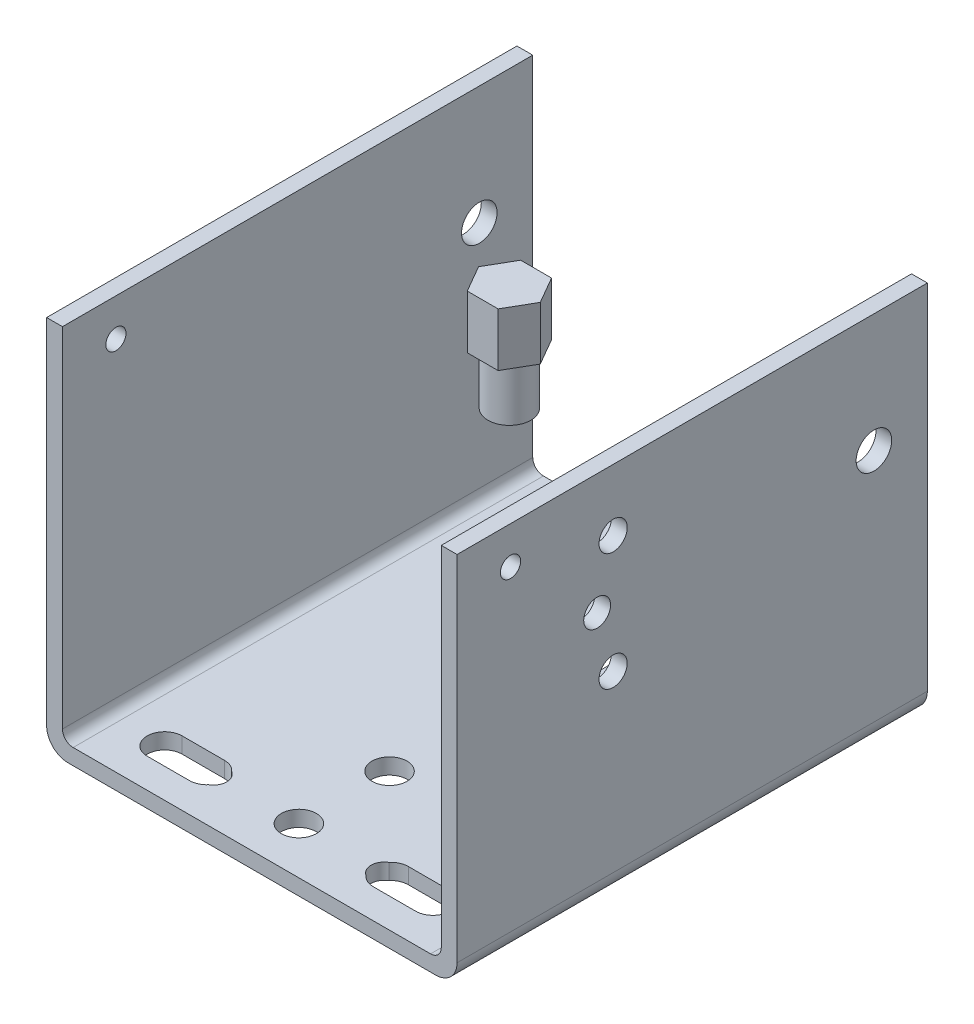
ISO-10303-21;
HEADER;
FILE_DESCRIPTION(('STEP AP214'),'2;1');
FILE_NAME('part.step','',(''),(''),'','','');
FILE_SCHEMA(('AUTOMOTIVE_DESIGN { 1 0 10303 214 1 1 1 1 }'));
ENDSEC;
DATA;
#1=APPLICATION_CONTEXT('core data for automotive mechanical design processes');
#2=APPLICATION_PROTOCOL_DEFINITION('international standard','automotive_design',2000,#1);
#3=PRODUCT_CONTEXT('',#1,'mechanical');
#4=PRODUCT('Part','Part','',(#3));
#5=PRODUCT_RELATED_PRODUCT_CATEGORY('part','',(#4));
#6=PRODUCT_DEFINITION_FORMATION('','',#4);
#7=PRODUCT_DEFINITION_CONTEXT('part definition',#1,'design');
#8=PRODUCT_DEFINITION('design','',#6,#7);
#9=PRODUCT_DEFINITION_SHAPE('','',#8);
#10=(LENGTH_UNIT() NAMED_UNIT(*) SI_UNIT(.MILLI.,.METRE.));
#11=(NAMED_UNIT(*) PLANE_ANGLE_UNIT() SI_UNIT($,.RADIAN.));
#12=(NAMED_UNIT(*) SI_UNIT($,.STERADIAN.) SOLID_ANGLE_UNIT());
#13=UNCERTAINTY_MEASURE_WITH_UNIT(LENGTH_MEASURE(1.E-05),#10,'distance_accuracy_value','');
#14=(GEOMETRIC_REPRESENTATION_CONTEXT(3) GLOBAL_UNCERTAINTY_ASSIGNED_CONTEXT((#13)) GLOBAL_UNIT_ASSIGNED_CONTEXT((#10,
#11,#12)) REPRESENTATION_CONTEXT('',''));
#15=CARTESIAN_POINT('',(0.,0.,0.));
#16=DIRECTION('',(0.,0.,1.));
#17=DIRECTION('',(1.,0.,0.));
#18=AXIS2_PLACEMENT_3D('',#15,#16,#17);
#19=CARTESIAN_POINT('',(21.6193644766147,142.875,93.98));
#20=DIRECTION('',(0.866025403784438,0.,-0.500000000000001));
#21=DIRECTION('',(-0.500000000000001,0.,-0.866025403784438));
#22=AXIS2_PLACEMENT_3D('',#19,#20,#21);
#23=PLANE('',#22);
#24=DIRECTION('',(0.500000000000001,0.,0.866025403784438));
#25=VECTOR('',#24,1.);
#26=CARTESIAN_POINT('',(21.6193644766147,127.,93.98));
#27=LINE('',#26,#25);
#28=CARTESIAN_POINT('',(21.6193644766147,127.,93.98));
#29=VERTEX_POINT('',#28);
#30=CARTESIAN_POINT('',(26.2020822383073,127.,101.9175));
#31=VERTEX_POINT('',#30);
#32=EDGE_CURVE('E129',#29,#31,#27,.T.);
#33=ORIENTED_EDGE('',*,*,#32,.T.);
#34=DIRECTION('',(0.,-1.,0.));
#35=VECTOR('',#34,1.);
#36=CARTESIAN_POINT('',(26.2020822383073,142.875,101.9175));
#37=LINE('',#36,#35);
#38=CARTESIAN_POINT('',(26.2020822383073,142.875,101.9175));
#39=VERTEX_POINT('',#38);
#40=EDGE_CURVE('E12',#39,#31,#37,.T.);
#41=ORIENTED_EDGE('',*,*,#40,.F.);
#42=DIRECTION('',(0.500000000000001,0.,0.866025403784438));
#43=VECTOR('',#42,1.);
#44=CARTESIAN_POINT('',(21.6193644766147,142.875,93.98));
#45=LINE('',#44,#43);
#46=CARTESIAN_POINT('',(21.6193644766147,142.875,93.98));
#47=VERTEX_POINT('',#46);
#48=EDGE_CURVE('E140',#47,#39,#45,.T.);
#49=ORIENTED_EDGE('',*,*,#48,.F.);
#50=DIRECTION('',(0.,-1.,0.));
#51=VECTOR('',#50,1.);
#52=CARTESIAN_POINT('',(21.6193644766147,142.875,93.98));
#53=LINE('',#52,#51);
#54=EDGE_CURVE('E125',#47,#29,#53,.T.);
#55=ORIENTED_EDGE('',*,*,#54,.T.);
#56=EDGE_LOOP('',(#33,#41,#49,#55));
#57=FACE_BOUND('',#56,.T.);
#58=ADVANCED_FACE('F45',(#57),#23,.F.);
#59=CARTESIAN_POINT('',(26.2020822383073,142.875,101.9175));
#60=DIRECTION('',(0.,0.,-1.));
#61=DIRECTION('',(-1.,0.,0.));
#62=AXIS2_PLACEMENT_3D('',#59,#60,#61);
#63=PLANE('',#62);
#64=DIRECTION('',(1.,0.,0.));
#65=VECTOR('',#64,1.);
#66=CARTESIAN_POINT('',(26.2020822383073,127.,101.9175));
#67=LINE('',#66,#65);
#68=CARTESIAN_POINT('',(35.3675177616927,127.,101.9175));
#69=VERTEX_POINT('',#68);
#70=EDGE_CURVE('E132',#31,#69,#67,.T.);
#71=ORIENTED_EDGE('',*,*,#70,.T.);
#72=DIRECTION('',(0.,-1.,0.));
#73=VECTOR('',#72,1.);
#74=CARTESIAN_POINT('',(35.3675177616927,142.875,101.9175));
#75=LINE('',#74,#73);
#76=CARTESIAN_POINT('',(35.3675177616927,142.875,101.9175));
#77=VERTEX_POINT('',#76);
#78=EDGE_CURVE('E53',#77,#69,#75,.T.);
#79=ORIENTED_EDGE('',*,*,#78,.F.);
#80=DIRECTION('',(1.,0.,0.));
#81=VECTOR('',#80,1.);
#82=CARTESIAN_POINT('',(26.2020822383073,142.875,101.9175));
#83=LINE('',#82,#81);
#84=EDGE_CURVE('E98',#39,#77,#83,.T.);
#85=ORIENTED_EDGE('',*,*,#84,.F.);
#86=ORIENTED_EDGE('',*,*,#40,.T.);
#87=EDGE_LOOP('',(#71,#79,#85,#86));
#88=FACE_BOUND('',#87,.T.);
#89=ADVANCED_FACE('F164',(#88),#63,.F.);
#90=CARTESIAN_POINT('',(35.3675177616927,142.875,101.9175));
#91=DIRECTION('',(-0.866025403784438,0.,-0.500000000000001));
#92=DIRECTION('',(-0.500000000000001,0.,0.866025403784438));
#93=AXIS2_PLACEMENT_3D('',#90,#91,#92);
#94=PLANE('',#93);
#95=DIRECTION('',(0.500000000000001,0.,-0.866025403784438));
#96=VECTOR('',#95,1.);
#97=CARTESIAN_POINT('',(35.3675177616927,127.,101.9175));
#98=LINE('',#97,#96);
#99=CARTESIAN_POINT('',(39.9502355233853,127.,93.98));
#100=VERTEX_POINT('',#99);
#101=EDGE_CURVE('E135',#69,#100,#98,.T.);
#102=ORIENTED_EDGE('',*,*,#101,.T.);
#103=DIRECTION('',(0.,-1.,0.));
#104=VECTOR('',#103,1.);
#105=CARTESIAN_POINT('',(39.9502355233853,142.875,93.98));
#106=LINE('',#105,#104);
#107=CARTESIAN_POINT('',(39.9502355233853,142.875,93.98));
#108=VERTEX_POINT('',#107);
#109=EDGE_CURVE('E120',#108,#100,#106,.T.);
#110=ORIENTED_EDGE('',*,*,#109,.F.);
#111=DIRECTION('',(0.500000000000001,0.,-0.866025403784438));
#112=VECTOR('',#111,1.);
#113=CARTESIAN_POINT('',(35.3675177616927,142.875,101.9175));
#114=LINE('',#113,#112);
#115=EDGE_CURVE('E111',#77,#108,#114,.T.);
#116=ORIENTED_EDGE('',*,*,#115,.F.);
#117=ORIENTED_EDGE('',*,*,#78,.T.);
#118=EDGE_LOOP('',(#102,#110,#116,#117));
#119=FACE_BOUND('',#118,.T.);
#120=ADVANCED_FACE('F146',(#119),#94,.F.);
#121=CARTESIAN_POINT('',(39.9502355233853,142.875,93.98));
#122=DIRECTION('',(-0.866025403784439,0.,0.5));
#123=DIRECTION('',(0.5,0.,0.866025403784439));
#124=AXIS2_PLACEMENT_3D('',#121,#122,#123);
#125=PLANE('',#124);
#126=DIRECTION('',(-0.5,0.,-0.866025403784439));
#127=VECTOR('',#126,1.);
#128=CARTESIAN_POINT('',(39.9502355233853,127.,93.98));
#129=LINE('',#128,#127);
#130=CARTESIAN_POINT('',(35.3675177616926,127.,86.0425));
#131=VERTEX_POINT('',#130);
#132=EDGE_CURVE('E119',#100,#131,#129,.T.);
#133=ORIENTED_EDGE('',*,*,#132,.T.);
#134=DIRECTION('',(0.,-1.,0.));
#135=VECTOR('',#134,1.);
#136=CARTESIAN_POINT('',(35.3675177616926,142.875,86.0425));
#137=LINE('',#136,#135);
#138=CARTESIAN_POINT('',(35.3675177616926,142.875,86.0425));
#139=VERTEX_POINT('',#138);
#140=EDGE_CURVE('E116',#139,#131,#137,.T.);
#141=ORIENTED_EDGE('',*,*,#140,.F.);
#142=DIRECTION('',(-0.5,0.,-0.866025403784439));
#143=VECTOR('',#142,1.);
#144=CARTESIAN_POINT('',(39.9502355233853,142.875,93.98));
#145=LINE('',#144,#143);
#146=EDGE_CURVE('E105',#108,#139,#145,.T.);
#147=ORIENTED_EDGE('',*,*,#146,.F.);
#148=ORIENTED_EDGE('',*,*,#109,.T.);
#149=EDGE_LOOP('',(#133,#141,#147,#148));
#150=FACE_BOUND('',#149,.T.);
#151=ADVANCED_FACE('F117',(#150),#125,.F.);
#152=CARTESIAN_POINT('',(35.3675177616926,142.875,86.0425));
#153=DIRECTION('',(0.,0.,1.));
#154=DIRECTION('',(1.,0.,0.));
#155=AXIS2_PLACEMENT_3D('',#152,#153,#154);
#156=PLANE('',#155);
#157=DIRECTION('',(-1.,0.,0.));
#158=VECTOR('',#157,1.);
#159=CARTESIAN_POINT('',(35.3675177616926,127.,86.0425));
#160=LINE('',#159,#158);
#161=CARTESIAN_POINT('',(26.2020822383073,127.,86.0425));
#162=VERTEX_POINT('',#161);
#163=EDGE_CURVE('E84',#131,#162,#160,.T.);
#164=ORIENTED_EDGE('',*,*,#163,.T.);
#165=DIRECTION('',(0.,-1.,0.));
#166=VECTOR('',#165,1.);
#167=CARTESIAN_POINT('',(26.2020822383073,142.875,86.0425));
#168=LINE('',#167,#166);
#169=CARTESIAN_POINT('',(26.2020822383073,142.875,86.0425));
#170=VERTEX_POINT('',#169);
#171=EDGE_CURVE('E121',#170,#162,#168,.T.);
#172=ORIENTED_EDGE('',*,*,#171,.F.);
#173=DIRECTION('',(-1.,0.,0.));
#174=VECTOR('',#173,1.);
#175=CARTESIAN_POINT('',(35.3675177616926,142.875,86.0425));
#176=LINE('',#175,#174);
#177=EDGE_CURVE('E109',#139,#170,#176,.T.);
#178=ORIENTED_EDGE('',*,*,#177,.F.);
#179=ORIENTED_EDGE('',*,*,#140,.T.);
#180=EDGE_LOOP('',(#164,#172,#178,#179));
#181=FACE_BOUND('',#180,.T.);
#182=ADVANCED_FACE('F123',(#181),#156,.F.);
#183=CARTESIAN_POINT('',(26.2020822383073,142.875,86.0425));
#184=DIRECTION('',(0.866025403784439,0.,0.5));
#185=DIRECTION('',(0.5,0.,-0.866025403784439));
#186=AXIS2_PLACEMENT_3D('',#183,#184,#185);
#187=PLANE('',#186);
#188=DIRECTION('',(-0.5,0.,0.866025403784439));
#189=VECTOR('',#188,1.);
#190=CARTESIAN_POINT('',(26.2020822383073,127.,86.0425));
#191=LINE('',#190,#189);
#192=EDGE_CURVE('E90',#162,#29,#191,.T.);
#193=ORIENTED_EDGE('',*,*,#192,.T.);
#194=ORIENTED_EDGE('',*,*,#54,.F.);
#195=DIRECTION('',(-0.5,0.,0.866025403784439));
#196=VECTOR('',#195,1.);
#197=CARTESIAN_POINT('',(26.2020822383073,142.875,86.0425));
#198=LINE('',#197,#196);
#199=EDGE_CURVE('E61',#170,#47,#198,.T.);
#200=ORIENTED_EDGE('',*,*,#199,.F.);
#201=ORIENTED_EDGE('',*,*,#171,.T.);
#202=EDGE_LOOP('',(#193,#194,#200,#201));
#203=FACE_BOUND('',#202,.T.);
#204=ADVANCED_FACE('F153',(#203),#187,.F.);
#205=CARTESIAN_POINT('',(0.,142.875,0.));
#206=DIRECTION('',(0.,1.,0.));
#207=DIRECTION('',(0.,0.,1.));
#208=AXIS2_PLACEMENT_3D('',#205,#206,#207);
#209=PLANE('',#208);
#210=ORIENTED_EDGE('',*,*,#48,.T.);
#211=ORIENTED_EDGE('',*,*,#84,.T.);
#212=ORIENTED_EDGE('',*,*,#115,.T.);
#213=ORIENTED_EDGE('',*,*,#146,.T.);
#214=ORIENTED_EDGE('',*,*,#177,.T.);
#215=ORIENTED_EDGE('',*,*,#199,.T.);
#216=EDGE_LOOP('',(#210,#211,#212,#213,#214,#215));
#217=FACE_BOUND('',#216,.T.);
#218=ADVANCED_FACE('F107',(#217),#209,.T.);
#219=CARTESIAN_POINT('',(0.,127.,0.));
#220=DIRECTION('',(0.,1.,0.));
#221=DIRECTION('',(0.,0.,1.));
#222=AXIS2_PLACEMENT_3D('',#219,#220,#221);
#223=PLANE('',#222);
#224=CARTESIAN_POINT('',(30.7848,127.,93.98));
#225=DIRECTION('',(0.,1.,0.));
#226=DIRECTION('',(0.,0.,1.));
#227=AXIS2_PLACEMENT_3D('',#224,#225,#226);
#228=CIRCLE('',#227,6.35);
#229=CARTESIAN_POINT('',(30.7848,127.,100.33));
#230=VERTEX_POINT('',#229);
#231=EDGE_CURVE('E226',#230,#230,#228,.T.);
#232=ORIENTED_EDGE('',*,*,#231,.T.);
#233=EDGE_LOOP('',(#232));
#234=FACE_BOUND('',#233,.T.);
#235=ORIENTED_EDGE('',*,*,#32,.F.);
#236=ORIENTED_EDGE('',*,*,#192,.F.);
#237=ORIENTED_EDGE('',*,*,#163,.F.);
#238=ORIENTED_EDGE('',*,*,#132,.F.);
#239=ORIENTED_EDGE('',*,*,#101,.F.);
#240=ORIENTED_EDGE('',*,*,#70,.F.);
#241=EDGE_LOOP('',(#235,#236,#237,#238,#239,#240));
#242=FACE_BOUND('',#241,.T.);
#243=ADVANCED_FACE('F149',(#234,#242),#223,.F.);
#244=CARTESIAN_POINT('',(30.7848,111.125,93.98));
#245=DIRECTION('',(0.,1.,0.));
#246=DIRECTION('',(0.,0.,1.));
#247=AXIS2_PLACEMENT_3D('',#244,#245,#246);
#248=CYLINDRICAL_SURFACE('',#247,6.35);
#249=CARTESIAN_POINT('',(30.7848,111.125,93.98));
#250=DIRECTION('',(0.,1.,0.));
#251=DIRECTION('',(0.,0.,1.));
#252=AXIS2_PLACEMENT_3D('',#249,#250,#251);
#253=CIRCLE('',#252,6.35);
#254=CARTESIAN_POINT('',(30.7848,111.125,100.33));
#255=VERTEX_POINT('',#254);
#256=EDGE_CURVE('E133',#255,#255,#253,.T.);
#257=ORIENTED_EDGE('',*,*,#256,.T.);
#258=EDGE_LOOP('',(#257));
#259=FACE_BOUND('',#258,.T.);
#260=ORIENTED_EDGE('',*,*,#231,.F.);
#261=EDGE_LOOP('',(#260));
#262=FACE_BOUND('',#261,.T.);
#263=ADVANCED_FACE('F201',(#259,#262),#248,.T.);
#264=CARTESIAN_POINT('',(30.7848,111.125,93.98));
#265=DIRECTION('',(0.,1.,0.));
#266=DIRECTION('',(0.,0.,1.));
#267=AXIS2_PLACEMENT_3D('',#264,#265,#266);
#268=PLANE('',#267);
#269=ORIENTED_EDGE('',*,*,#256,.F.);
#270=EDGE_LOOP('',(#269));
#271=FACE_BOUND('',#270,.T.);
#272=ADVANCED_FACE('F210',(#271),#268,.F.);
#273=CLOSED_SHELL('',(#58,#89,#120,#151,#182,#204,#218,#243,#263,#272));
#274=MANIFOLD_SOLID_BREP('B2',#273);
#275=CARTESIAN_POINT('',(0.,0.,139.7));
#276=DIRECTION('',(0.,1.,0.));
#277=DIRECTION('',(0.,0.,1.));
#278=AXIS2_PLACEMENT_3D('',#275,#276,#277);
#279=PLANE('',#278);
#280=CARTESIAN_POINT('',(25.4,0.,125.73));
#281=DIRECTION('',(0.,1.,0.));
#282=DIRECTION('',(0.,0.,1.));
#283=AXIS2_PLACEMENT_3D('',#280,#281,#282);
#284=CIRCLE('',#283,3.9624);
#285=CARTESIAN_POINT('',(23.3571626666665,0.,122.334793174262));
#286=VERTEX_POINT('',#285);
#287=CARTESIAN_POINT('',(23.3571626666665,0.,129.125206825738));
#288=VERTEX_POINT('',#287);
#289=EDGE_CURVE('E435',#286,#288,#284,.T.);
#290=ORIENTED_EDGE('',*,*,#289,.T.);
#291=CARTESIAN_POINT('',(27.305,0.,125.73));
#292=DIRECTION('',(0.,1.,0.));
#293=DIRECTION('',(0.,0.,1.));
#294=AXIS2_PLACEMENT_3D('',#291,#292,#293);
#295=CIRCLE('',#294,5.20700000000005);
#296=CARTESIAN_POINT('',(27.305,0.,130.937));
#297=VERTEX_POINT('',#296);
#298=EDGE_CURVE('E455',#288,#297,#295,.T.);
#299=ORIENTED_EDGE('',*,*,#298,.T.);
#300=DIRECTION('',(1.,0.,0.));
#301=VECTOR('',#300,1.);
#302=CARTESIAN_POINT('',(27.305,0.,130.937));
#303=LINE('',#302,#301);
#304=CARTESIAN_POINT('',(39.878,0.,130.937));
#305=VERTEX_POINT('',#304);
#306=EDGE_CURVE('E454',#297,#305,#303,.T.);
#307=ORIENTED_EDGE('',*,*,#306,.T.);
#308=CARTESIAN_POINT('',(39.878,0.,125.73));
#309=DIRECTION('',(0.,1.,0.));
#310=DIRECTION('',(0.,0.,1.));
#311=AXIS2_PLACEMENT_3D('',#308,#309,#310);
#312=CIRCLE('',#311,5.20700000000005);
#313=CARTESIAN_POINT('',(39.878,0.,120.523));
#314=VERTEX_POINT('',#313);
#315=EDGE_CURVE('E458',#305,#314,#312,.T.);
#316=ORIENTED_EDGE('',*,*,#315,.T.);
#317=DIRECTION('',(-1.,0.,0.));
#318=VECTOR('',#317,1.);
#319=CARTESIAN_POINT('',(27.305,0.,120.523));
#320=LINE('',#319,#318);
#321=CARTESIAN_POINT('',(27.305,0.,120.523));
#322=VERTEX_POINT('',#321);
#323=EDGE_CURVE('E453',#314,#322,#320,.T.);
#324=ORIENTED_EDGE('',*,*,#323,.T.);
#325=EDGE_CURVE('E445',#322,#286,#295,.T.);
#326=ORIENTED_EDGE('',*,*,#325,.T.);
#327=EDGE_LOOP('',(#290,#299,#307,#316,#324,#326));
#328=FACE_BOUND('',#327,.T.);
#329=CARTESIAN_POINT('',(0.,0.,98.806));
#330=DIRECTION('',(0.,1.,0.));
#331=DIRECTION('',(0.,0.,1.));
#332=AXIS2_PLACEMENT_3D('',#329,#330,#331);
#333=CIRCLE('',#332,5.207);
#334=CARTESIAN_POINT('',(0.,0.,104.013));
#335=VERTEX_POINT('',#334);
#336=EDGE_CURVE('E665',#335,#335,#333,.T.);
#337=ORIENTED_EDGE('',*,*,#336,.T.);
#338=EDGE_LOOP('',(#337));
#339=FACE_BOUND('',#338,.T.);
#340=CARTESIAN_POINT('',(0.,0.,46.355));
#341=DIRECTION('',(0.,1.,0.));
#342=DIRECTION('',(0.,0.,1.));
#343=AXIS2_PLACEMENT_3D('',#340,#341,#342);
#344=CIRCLE('',#343,5.334);
#345=CARTESIAN_POINT('',(-5.334,0.,46.355));
#346=VERTEX_POINT('',#345);
#347=CARTESIAN_POINT('',(5.334,0.,46.355));
#348=VERTEX_POINT('',#347);
#349=EDGE_CURVE('E660',#346,#348,#344,.T.);
#350=ORIENTED_EDGE('',*,*,#349,.T.);
#351=DIRECTION('',(0.,0.,-1.));
#352=VECTOR('',#351,1.);
#353=CARTESIAN_POINT('',(5.334,0.,15.875));
#354=LINE('',#353,#352);
#355=CARTESIAN_POINT('',(5.334,0.,15.875));
#356=VERTEX_POINT('',#355);
#357=EDGE_CURVE('E1114',#348,#356,#354,.T.);
#358=ORIENTED_EDGE('',*,*,#357,.T.);
#359=CARTESIAN_POINT('',(0.,0.,15.875));
#360=DIRECTION('',(0.,1.,0.));
#361=DIRECTION('',(0.,0.,1.));
#362=AXIS2_PLACEMENT_3D('',#359,#360,#361);
#363=CIRCLE('',#362,5.334);
#364=CARTESIAN_POINT('',(-5.334,0.,15.875));
#365=VERTEX_POINT('',#364);
#366=EDGE_CURVE('E1117',#356,#365,#363,.T.);
#367=ORIENTED_EDGE('',*,*,#366,.T.);
#368=DIRECTION('',(0.,0.,1.));
#369=VECTOR('',#368,1.);
#370=CARTESIAN_POINT('',(-5.334,0.,15.875));
#371=LINE('',#370,#369);
#372=EDGE_CURVE('E1120',#365,#346,#371,.T.);
#373=ORIENTED_EDGE('',*,*,#372,.T.);
#374=EDGE_LOOP('',(#350,#358,#367,#373));
#375=FACE_BOUND('',#374,.T.);
#376=DIRECTION('',(1.,0.,0.));
#377=VECTOR('',#376,1.);
#378=CARTESIAN_POINT('',(-60.96,0.,139.7));
#379=LINE('',#378,#377);
#380=CARTESIAN_POINT('',(-54.61,0.,139.7));
#381=VERTEX_POINT('',#380);
#382=CARTESIAN_POINT('',(54.61,0.,139.7));
#383=VERTEX_POINT('',#382);
#384=EDGE_CURVE('E531',#381,#383,#379,.T.);
#385=ORIENTED_EDGE('',*,*,#384,.F.);
#386=DIRECTION('',(0.,0.,-1.));
#387=VECTOR('',#386,1.);
#388=CARTESIAN_POINT('',(-54.61,0.,139.7));
#389=LINE('',#388,#387);
#390=CARTESIAN_POINT('',(-54.61,0.,0.));
#391=VERTEX_POINT('',#390);
#392=EDGE_CURVE('E602',#381,#391,#389,.T.);
#393=ORIENTED_EDGE('',*,*,#392,.T.);
#394=DIRECTION('',(1.,0.,0.));
#395=VECTOR('',#394,1.);
#396=CARTESIAN_POINT('',(0.,0.,0.));
#397=LINE('',#396,#395);
#398=CARTESIAN_POINT('',(54.61,0.,0.));
#399=VERTEX_POINT('',#398);
#400=EDGE_CURVE('E530',#391,#399,#397,.T.);
#401=ORIENTED_EDGE('',*,*,#400,.T.);
#402=DIRECTION('',(0.,0.,-1.));
#403=VECTOR('',#402,1.);
#404=CARTESIAN_POINT('',(54.61,0.,139.7));
#405=LINE('',#404,#403);
#406=EDGE_CURVE('E600',#399,#383,#405,.F.);
#407=ORIENTED_EDGE('',*,*,#406,.T.);
#408=EDGE_LOOP('',(#385,#393,#401,#407));
#409=FACE_BOUND('',#408,.T.);
#410=CARTESIAN_POINT('',(0.,0.,125.73));
#411=DIRECTION('',(0.,1.,0.));
#412=DIRECTION('',(0.,0.,1.));
#413=AXIS2_PLACEMENT_3D('',#410,#411,#412);
#414=CIRCLE('',#413,5.207);
#415=CARTESIAN_POINT('',(0.,0.,130.937));
#416=VERTEX_POINT('',#415);
#417=EDGE_CURVE('E661',#416,#416,#414,.T.);
#418=ORIENTED_EDGE('',*,*,#417,.T.);
#419=EDGE_LOOP('',(#418));
#420=FACE_BOUND('',#419,.T.);
#421=CARTESIAN_POINT('',(-25.4,0.,125.73));
#422=DIRECTION('',(0.,1.,0.));
#423=DIRECTION('',(0.,0.,1.));
#424=AXIS2_PLACEMENT_3D('',#421,#422,#423);
#425=CIRCLE('',#424,3.9624);
#426=CARTESIAN_POINT('',(-23.3571626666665,0.,129.125206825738));
#427=VERTEX_POINT('',#426);
#428=CARTESIAN_POINT('',(-23.3571626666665,0.,122.334793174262));
#429=VERTEX_POINT('',#428);
#430=EDGE_CURVE('E1104',#427,#429,#425,.T.);
#431=ORIENTED_EDGE('',*,*,#430,.T.);
#432=CARTESIAN_POINT('',(-27.305,0.,125.73));
#433=DIRECTION('',(0.,1.,0.));
#434=DIRECTION('',(0.,0.,1.));
#435=AXIS2_PLACEMENT_3D('',#432,#433,#434);
#436=CIRCLE('',#435,5.20700000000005);
#437=CARTESIAN_POINT('',(-27.305,0.,120.523));
#438=VERTEX_POINT('',#437);
#439=EDGE_CURVE('E481',#429,#438,#436,.T.);
#440=ORIENTED_EDGE('',*,*,#439,.T.);
#441=DIRECTION('',(-1.,0.,0.));
#442=VECTOR('',#441,1.);
#443=CARTESIAN_POINT('',(-39.878,0.,120.523));
#444=LINE('',#443,#442);
#445=CARTESIAN_POINT('',(-39.878,0.,120.523));
#446=VERTEX_POINT('',#445);
#447=EDGE_CURVE('E485',#438,#446,#444,.T.);
#448=ORIENTED_EDGE('',*,*,#447,.T.);
#449=CARTESIAN_POINT('',(-39.878,0.,125.73));
#450=DIRECTION('',(0.,1.,0.));
#451=DIRECTION('',(0.,0.,1.));
#452=AXIS2_PLACEMENT_3D('',#449,#450,#451);
#453=CIRCLE('',#452,5.20700000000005);
#454=CARTESIAN_POINT('',(-39.878,0.,130.937));
#455=VERTEX_POINT('',#454);
#456=EDGE_CURVE('E475',#446,#455,#453,.T.);
#457=ORIENTED_EDGE('',*,*,#456,.T.);
#458=DIRECTION('',(1.,0.,0.));
#459=VECTOR('',#458,1.);
#460=CARTESIAN_POINT('',(-39.878,0.,130.937));
#461=LINE('',#460,#459);
#462=CARTESIAN_POINT('',(-27.305,0.,130.937));
#463=VERTEX_POINT('',#462);
#464=EDGE_CURVE('E478',#455,#463,#461,.T.);
#465=ORIENTED_EDGE('',*,*,#464,.T.);
#466=EDGE_CURVE('E482',#463,#427,#436,.T.);
#467=ORIENTED_EDGE('',*,*,#466,.T.);
#468=EDGE_LOOP('',(#431,#440,#448,#457,#465,#467));
#469=FACE_BOUND('',#468,.T.);
#470=CARTESIAN_POINT('',(-25.4,0.,14.605));
#471=DIRECTION('',(0.,1.,0.));
#472=DIRECTION('',(0.,0.,1.));
#473=AXIS2_PLACEMENT_3D('',#470,#471,#472);
#474=CIRCLE('',#473,3.9624);
#475=CARTESIAN_POINT('',(-25.4,0.,18.5674));
#476=VERTEX_POINT('',#475);
#477=EDGE_CURVE('E1096',#476,#476,#474,.T.);
#478=ORIENTED_EDGE('',*,*,#477,.T.);
#479=EDGE_LOOP('',(#478));
#480=FACE_BOUND('',#479,.T.);
#481=ADVANCED_FACE('F251',(#328,#339,#375,#409,#420,#469,#480),#279,.F.);
#482=CARTESIAN_POINT('',(56.261,4.69899999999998,139.7));
#483=DIRECTION('',(0.,-1.,0.));
#484=DIRECTION('',(0.,0.,-1.));
#485=AXIS2_PLACEMENT_3D('',#482,#483,#484);
#486=PLANE('',#485);
#487=CARTESIAN_POINT('',(25.4,4.69899999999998,125.73));
#488=DIRECTION('',(0.,-1.,0.));
#489=DIRECTION('',(0.,0.,-1.));
#490=AXIS2_PLACEMENT_3D('',#487,#488,#489);
#491=CIRCLE('',#490,3.9624);
#492=CARTESIAN_POINT('',(23.3571626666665,4.69899999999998,122.334793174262));
#493=VERTEX_POINT('',#492);
#494=CARTESIAN_POINT('',(23.3571626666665,4.69899999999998,129.125206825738));
#495=VERTEX_POINT('',#494);
#496=EDGE_CURVE('E267',#493,#495,#491,.F.);
#497=ORIENTED_EDGE('',*,*,#496,.F.);
#498=CARTESIAN_POINT('',(27.305,4.69899999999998,125.73));
#499=DIRECTION('',(0.,-1.,0.));
#500=DIRECTION('',(0.,0.,-1.));
#501=AXIS2_PLACEMENT_3D('',#498,#499,#500);
#502=CIRCLE('',#501,5.20700000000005);
#503=CARTESIAN_POINT('',(27.305,4.69899999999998,120.523));
#504=VERTEX_POINT('',#503);
#505=EDGE_CURVE('E448',#504,#493,#502,.F.);
#506=ORIENTED_EDGE('',*,*,#505,.F.);
#507=DIRECTION('',(-1.,0.,0.));
#508=VECTOR('',#507,1.);
#509=CARTESIAN_POINT('',(56.261,4.69899999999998,120.523));
#510=LINE('',#509,#508);
#511=CARTESIAN_POINT('',(39.878,4.69899999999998,120.523));
#512=VERTEX_POINT('',#511);
#513=EDGE_CURVE('E638',#512,#504,#510,.T.);
#514=ORIENTED_EDGE('',*,*,#513,.F.);
#515=CARTESIAN_POINT('',(39.878,4.69899999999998,125.73));
#516=DIRECTION('',(0.,-1.,0.));
#517=DIRECTION('',(0.,0.,-1.));
#518=AXIS2_PLACEMENT_3D('',#515,#516,#517);
#519=CIRCLE('',#518,5.20700000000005);
#520=CARTESIAN_POINT('',(39.878,4.69899999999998,130.937));
#521=VERTEX_POINT('',#520);
#522=EDGE_CURVE('E640',#521,#512,#519,.F.);
#523=ORIENTED_EDGE('',*,*,#522,.F.);
#524=DIRECTION('',(1.,0.,0.));
#525=VECTOR('',#524,1.);
#526=CARTESIAN_POINT('',(56.261,4.69899999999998,130.937));
#527=LINE('',#526,#525);
#528=CARTESIAN_POINT('',(27.305,4.69899999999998,130.937));
#529=VERTEX_POINT('',#528);
#530=EDGE_CURVE('E643',#529,#521,#527,.T.);
#531=ORIENTED_EDGE('',*,*,#530,.F.);
#532=EDGE_CURVE('E645',#495,#529,#502,.F.);
#533=ORIENTED_EDGE('',*,*,#532,.F.);
#534=EDGE_LOOP('',(#497,#506,#514,#523,#531,#533));
#535=FACE_BOUND('',#534,.T.);
#536=CARTESIAN_POINT('',(0.,4.69899999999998,98.806));
#537=DIRECTION('',(0.,-1.,0.));
#538=DIRECTION('',(0.,0.,-1.));
#539=AXIS2_PLACEMENT_3D('',#536,#537,#538);
#540=CIRCLE('',#539,5.207);
#541=CARTESIAN_POINT('',(0.,4.69899999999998,93.599));
#542=VERTEX_POINT('',#541);
#543=EDGE_CURVE('E662',#542,#542,#540,.F.);
#544=ORIENTED_EDGE('',*,*,#543,.F.);
#545=EDGE_LOOP('',(#544));
#546=FACE_BOUND('',#545,.T.);
#547=CARTESIAN_POINT('',(0.,4.69899999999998,46.355));
#548=DIRECTION('',(0.,-1.,0.));
#549=DIRECTION('',(0.,0.,-1.));
#550=AXIS2_PLACEMENT_3D('',#547,#548,#549);
#551=CIRCLE('',#550,5.334);
#552=CARTESIAN_POINT('',(-5.334,4.69899999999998,46.355));
#553=VERTEX_POINT('',#552);
#554=CARTESIAN_POINT('',(5.334,4.69899999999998,46.355));
#555=VERTEX_POINT('',#554);
#556=EDGE_CURVE('E654',#553,#555,#551,.F.);
#557=ORIENTED_EDGE('',*,*,#556,.F.);
#558=DIRECTION('',(0.,0.,1.));
#559=VECTOR('',#558,1.);
#560=CARTESIAN_POINT('',(-5.33399999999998,4.69899999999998,139.7));
#561=LINE('',#560,#559);
#562=CARTESIAN_POINT('',(-5.334,4.69899999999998,15.875));
#563=VERTEX_POINT('',#562);
#564=EDGE_CURVE('E647',#563,#553,#561,.T.);
#565=ORIENTED_EDGE('',*,*,#564,.F.);
#566=CARTESIAN_POINT('',(0.,4.69899999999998,15.875));
#567=DIRECTION('',(0.,-1.,0.));
#568=DIRECTION('',(0.,0.,-1.));
#569=AXIS2_PLACEMENT_3D('',#566,#567,#568);
#570=CIRCLE('',#569,5.334);
#571=CARTESIAN_POINT('',(5.334,4.69899999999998,15.875));
#572=VERTEX_POINT('',#571);
#573=EDGE_CURVE('E649',#572,#563,#570,.F.);
#574=ORIENTED_EDGE('',*,*,#573,.F.);
#575=DIRECTION('',(0.,0.,-1.));
#576=VECTOR('',#575,1.);
#577=CARTESIAN_POINT('',(5.33400000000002,4.69899999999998,139.7));
#578=LINE('',#577,#576);
#579=EDGE_CURVE('E652',#555,#572,#578,.T.);
#580=ORIENTED_EDGE('',*,*,#579,.F.);
#581=EDGE_LOOP('',(#557,#565,#574,#580));
#582=FACE_BOUND('',#581,.T.);
#583=DIRECTION('',(-1.,0.,0.));
#584=VECTOR('',#583,1.);
#585=CARTESIAN_POINT('',(56.261,4.69899999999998,139.7));
#586=LINE('',#585,#584);
#587=CARTESIAN_POINT('',(53.086,4.69899999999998,139.7));
#588=VERTEX_POINT('',#587);
#589=CARTESIAN_POINT('',(-53.086,4.69899999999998,139.7));
#590=VERTEX_POINT('',#589);
#591=EDGE_CURVE('E542',#588,#590,#586,.T.);
#592=ORIENTED_EDGE('',*,*,#591,.F.);
#593=DIRECTION('',(0.,0.,-1.));
#594=VECTOR('',#593,1.);
#595=CARTESIAN_POINT('',(53.086,4.69899999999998,0.));
#596=LINE('',#595,#594);
#597=CARTESIAN_POINT('',(53.086,4.69899999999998,0.));
#598=VERTEX_POINT('',#597);
#599=EDGE_CURVE('E584',#588,#598,#596,.T.);
#600=ORIENTED_EDGE('',*,*,#599,.T.);
#601=DIRECTION('',(-1.,0.,0.));
#602=VECTOR('',#601,1.);
#603=CARTESIAN_POINT('',(56.261,4.69899999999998,0.));
#604=LINE('',#603,#602);
#605=CARTESIAN_POINT('',(-53.086,4.69899999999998,0.));
#606=VERTEX_POINT('',#605);
#607=EDGE_CURVE('E562',#598,#606,#604,.T.);
#608=ORIENTED_EDGE('',*,*,#607,.T.);
#609=DIRECTION('',(0.,0.,-1.));
#610=VECTOR('',#609,1.);
#611=CARTESIAN_POINT('',(-53.086,4.69899999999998,139.7));
#612=LINE('',#611,#610);
#613=EDGE_CURVE('E582',#606,#590,#612,.F.);
#614=ORIENTED_EDGE('',*,*,#613,.T.);
#615=EDGE_LOOP('',(#592,#600,#608,#614));
#616=FACE_BOUND('',#615,.T.);
#617=CARTESIAN_POINT('',(0.,4.69899999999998,125.73));
#618=DIRECTION('',(0.,-1.,0.));
#619=DIRECTION('',(0.,0.,-1.));
#620=AXIS2_PLACEMENT_3D('',#617,#618,#619);
#621=CIRCLE('',#620,5.207);
#622=CARTESIAN_POINT('',(0.,4.69899999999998,120.523));
#623=VERTEX_POINT('',#622);
#624=EDGE_CURVE('E657',#623,#623,#621,.F.);
#625=ORIENTED_EDGE('',*,*,#624,.F.);
#626=EDGE_LOOP('',(#625));
#627=FACE_BOUND('',#626,.T.);
#628=CARTESIAN_POINT('',(-25.4,4.69899999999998,125.73));
#629=DIRECTION('',(0.,-1.,0.));
#630=DIRECTION('',(0.,0.,-1.));
#631=AXIS2_PLACEMENT_3D('',#628,#629,#630);
#632=CIRCLE('',#631,3.9624);
#633=CARTESIAN_POINT('',(-23.3571626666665,4.69899999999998,129.125206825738));
#634=VERTEX_POINT('',#633);
#635=CARTESIAN_POINT('',(-23.3571626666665,4.69899999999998,122.334793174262));
#636=VERTEX_POINT('',#635);
#637=EDGE_CURVE('E275',#634,#636,#632,.F.);
#638=ORIENTED_EDGE('',*,*,#637,.F.);
#639=CARTESIAN_POINT('',(-27.305,4.69899999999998,125.73));
#640=DIRECTION('',(0.,-1.,0.));
#641=DIRECTION('',(0.,0.,-1.));
#642=AXIS2_PLACEMENT_3D('',#639,#640,#641);
#643=CIRCLE('',#642,5.20700000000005);
#644=CARTESIAN_POINT('',(-27.305,4.69899999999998,130.937));
#645=VERTEX_POINT('',#644);
#646=EDGE_CURVE('E631',#645,#634,#643,.F.);
#647=ORIENTED_EDGE('',*,*,#646,.F.);
#648=DIRECTION('',(1.,0.,0.));
#649=VECTOR('',#648,1.);
#650=CARTESIAN_POINT('',(56.261,4.69899999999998,130.937));
#651=LINE('',#650,#649);
#652=CARTESIAN_POINT('',(-39.878,4.69899999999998,130.937));
#653=VERTEX_POINT('',#652);
#654=EDGE_CURVE('E634',#653,#645,#651,.T.);
#655=ORIENTED_EDGE('',*,*,#654,.F.);
#656=CARTESIAN_POINT('',(-39.878,4.69899999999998,125.73));
#657=DIRECTION('',(0.,-1.,0.));
#658=DIRECTION('',(0.,0.,-1.));
#659=AXIS2_PLACEMENT_3D('',#656,#657,#658);
#660=CIRCLE('',#659,5.20700000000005);
#661=CARTESIAN_POINT('',(-39.878,4.69899999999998,120.523));
#662=VERTEX_POINT('',#661);
#663=EDGE_CURVE('E636',#662,#653,#660,.F.);
#664=ORIENTED_EDGE('',*,*,#663,.F.);
#665=DIRECTION('',(-1.,0.,0.));
#666=VECTOR('',#665,1.);
#667=CARTESIAN_POINT('',(56.261,4.69899999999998,120.523));
#668=LINE('',#667,#666);
#669=CARTESIAN_POINT('',(-27.305,4.69899999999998,120.523));
#670=VERTEX_POINT('',#669);
#671=EDGE_CURVE('E618',#670,#662,#668,.T.);
#672=ORIENTED_EDGE('',*,*,#671,.F.);
#673=EDGE_CURVE('E630',#636,#670,#643,.F.);
#674=ORIENTED_EDGE('',*,*,#673,.F.);
#675=EDGE_LOOP('',(#638,#647,#655,#664,#672,#674));
#676=FACE_BOUND('',#675,.T.);
#677=CARTESIAN_POINT('',(-25.4,4.69899999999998,14.605));
#678=DIRECTION('',(0.,-1.,0.));
#679=DIRECTION('',(0.,0.,-1.));
#680=AXIS2_PLACEMENT_3D('',#677,#678,#679);
#681=CIRCLE('',#680,3.9624);
#682=CARTESIAN_POINT('',(-25.4,4.69899999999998,10.6426));
#683=VERTEX_POINT('',#682);
#684=EDGE_CURVE('E255',#683,#683,#681,.F.);
#685=ORIENTED_EDGE('',*,*,#684,.F.);
#686=EDGE_LOOP('',(#685));
#687=FACE_BOUND('',#686,.T.);
#688=ADVANCED_FACE('F676',(#535,#546,#582,#616,#627,#676,#687),#486,.F.);
#689=CARTESIAN_POINT('',(27.305,25.4,125.73));
#690=DIRECTION('',(0.,-1.,0.));
#691=DIRECTION('',(0.,0.,-1.));
#692=AXIS2_PLACEMENT_3D('',#689,#690,#691);
#693=CYLINDRICAL_SURFACE('',#692,5.20700000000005);
#694=ORIENTED_EDGE('',*,*,#505,.T.);
#695=DIRECTION('',(0.,-1.,0.));
#696=VECTOR('',#695,1.);
#697=CARTESIAN_POINT('',(23.3571626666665,12.7,122.334793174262));
#698=LINE('',#697,#696);
#699=EDGE_CURVE('E43',#493,#286,#698,.T.);
#700=ORIENTED_EDGE('',*,*,#699,.T.);
#701=ORIENTED_EDGE('',*,*,#325,.F.);
#702=DIRECTION('',(0.,-1.,0.));
#703=VECTOR('',#702,1.);
#704=CARTESIAN_POINT('',(27.305,25.4,120.523));
#705=LINE('',#704,#703);
#706=EDGE_CURVE('E466',#504,#322,#705,.T.);
#707=ORIENTED_EDGE('',*,*,#706,.F.);
#708=EDGE_LOOP('',(#694,#700,#701,#707));
#709=FACE_BOUND('',#708,.T.);
#710=ADVANCED_FACE('F443',(#709),#693,.F.);
#711=ORIENTED_EDGE('',*,*,#298,.F.);
#712=DIRECTION('',(0.,-1.,0.));
#713=VECTOR('',#712,1.);
#714=CARTESIAN_POINT('',(23.3571626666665,12.7,129.125206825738));
#715=LINE('',#714,#713);
#716=EDGE_CURVE('E260',#288,#495,#715,.F.);
#717=ORIENTED_EDGE('',*,*,#716,.T.);
#718=ORIENTED_EDGE('',*,*,#532,.T.);
#719=DIRECTION('',(0.,-1.,0.));
#720=VECTOR('',#719,1.);
#721=CARTESIAN_POINT('',(27.305,25.4,130.937));
#722=LINE('',#721,#720);
#723=EDGE_CURVE('E472',#529,#297,#722,.T.);
#724=ORIENTED_EDGE('',*,*,#723,.T.);
#725=EDGE_LOOP('',(#711,#717,#718,#724));
#726=FACE_BOUND('',#725,.T.);
#727=ADVANCED_FACE('F672',(#726),#693,.F.);
#728=CARTESIAN_POINT('',(-27.305,25.4,125.73));
#729=DIRECTION('',(0.,-1.,0.));
#730=DIRECTION('',(0.,0.,-1.));
#731=AXIS2_PLACEMENT_3D('',#728,#729,#730);
#732=CYLINDRICAL_SURFACE('',#731,5.20700000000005);
#733=ORIENTED_EDGE('',*,*,#646,.T.);
#734=DIRECTION('',(0.,-1.,0.));
#735=VECTOR('',#734,1.);
#736=CARTESIAN_POINT('',(-23.3571626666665,12.7,129.125206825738));
#737=LINE('',#736,#735);
#738=EDGE_CURVE('E667',#634,#427,#737,.T.);
#739=ORIENTED_EDGE('',*,*,#738,.T.);
#740=ORIENTED_EDGE('',*,*,#466,.F.);
#741=DIRECTION('',(0.,-1.,0.));
#742=VECTOR('',#741,1.);
#743=CARTESIAN_POINT('',(-27.305,25.4,130.937));
#744=LINE('',#743,#742);
#745=EDGE_CURVE('E494',#645,#463,#744,.T.);
#746=ORIENTED_EDGE('',*,*,#745,.F.);
#747=EDGE_LOOP('',(#733,#739,#740,#746));
#748=FACE_BOUND('',#747,.T.);
#749=ADVANCED_FACE('F803',(#748),#732,.F.);
#750=ORIENTED_EDGE('',*,*,#439,.F.);
#751=DIRECTION('',(0.,-1.,0.));
#752=VECTOR('',#751,1.);
#753=CARTESIAN_POINT('',(-23.3571626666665,12.7,122.334793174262));
#754=LINE('',#753,#752);
#755=EDGE_CURVE('E656',#429,#636,#754,.F.);
#756=ORIENTED_EDGE('',*,*,#755,.T.);
#757=ORIENTED_EDGE('',*,*,#673,.T.);
#758=DIRECTION('',(0.,-1.,0.));
#759=VECTOR('',#758,1.);
#760=CARTESIAN_POINT('',(-27.305,25.4,120.523));
#761=LINE('',#760,#759);
#762=EDGE_CURVE('E491',#670,#438,#761,.T.);
#763=ORIENTED_EDGE('',*,*,#762,.T.);
#764=EDGE_LOOP('',(#750,#756,#757,#763));
#765=FACE_BOUND('',#764,.T.);
#766=ADVANCED_FACE('F798',(#765),#732,.F.);
#767=CARTESIAN_POINT('',(60.96,0.,139.7));
#768=DIRECTION('',(-1.,0.,0.));
#769=DIRECTION('',(0.,0.,1.));
#770=AXIS2_PLACEMENT_3D('',#767,#768,#769);
#771=PLANE('',#770);
#772=CARTESIAN_POINT('',(60.96,93.0656,93.345));
#773=DIRECTION('',(-1.,0.,0.));
#774=DIRECTION('',(0.,0.,1.));
#775=AXIS2_PLACEMENT_3D('',#772,#773,#774);
#776=CIRCLE('',#775,4.191);
#777=CARTESIAN_POINT('',(60.96,93.0656,97.536));
#778=VERTEX_POINT('',#777);
#779=EDGE_CURVE('E503',#778,#778,#776,.F.);
#780=ORIENTED_EDGE('',*,*,#779,.F.);
#781=EDGE_LOOP('',(#780));
#782=FACE_BOUND('',#781,.T.);
#783=DIRECTION('',(0.,1.,0.));
#784=VECTOR('',#783,1.);
#785=CARTESIAN_POINT('',(60.96,0.,139.7));
#786=LINE('',#785,#784);
#787=CARTESIAN_POINT('',(60.96,6.35,139.7));
#788=VERTEX_POINT('',#787);
#789=CARTESIAN_POINT('',(60.96,111.379,139.7));
#790=VERTEX_POINT('',#789);
#791=EDGE_CURVE('E534',#788,#790,#786,.T.);
#792=ORIENTED_EDGE('',*,*,#791,.F.);
#793=DIRECTION('',(0.,0.,-1.));
#794=VECTOR('',#793,1.);
#795=CARTESIAN_POINT('',(60.96,6.35,139.7));
#796=LINE('',#795,#794);
#797=CARTESIAN_POINT('',(60.96,6.35,0.));
#798=VERTEX_POINT('',#797);
#799=EDGE_CURVE('E615',#788,#798,#796,.T.);
#800=ORIENTED_EDGE('',*,*,#799,.T.);
#801=DIRECTION('',(0.,1.,0.));
#802=VECTOR('',#801,1.);
#803=CARTESIAN_POINT('',(60.96,0.,0.));
#804=LINE('',#803,#802);
#805=CARTESIAN_POINT('',(60.96,111.379,0.));
#806=VERTEX_POINT('',#805);
#807=EDGE_CURVE('E555',#798,#806,#804,.T.);
#808=ORIENTED_EDGE('',*,*,#807,.T.);
#809=DIRECTION('',(0.,0.,-1.));
#810=VECTOR('',#809,1.);
#811=CARTESIAN_POINT('',(60.96,111.379,139.7));
#812=LINE('',#811,#810);
#813=EDGE_CURVE('E579',#790,#806,#812,.T.);
#814=ORIENTED_EDGE('',*,*,#813,.F.);
#815=EDGE_LOOP('',(#792,#800,#808,#814));
#816=FACE_BOUND('',#815,.T.);
#817=CARTESIAN_POINT('',(60.96,76.2,15.875));
#818=DIRECTION('',(-1.,0.,0.));
#819=DIRECTION('',(0.,0.,1.));
#820=AXIS2_PLACEMENT_3D('',#817,#818,#819);
#821=CIRCLE('',#820,5.2832);
#822=CARTESIAN_POINT('',(60.96,76.2,10.5918));
#823=VERTEX_POINT('',#822);
#824=EDGE_CURVE('E527',#823,#823,#821,.T.);
#825=ORIENTED_EDGE('',*,*,#824,.T.);
#826=EDGE_LOOP('',(#825));
#827=FACE_BOUND('',#826,.T.);
#828=CARTESIAN_POINT('',(60.96,100.2538,123.825));
#829=DIRECTION('',(-1.,0.,0.));
#830=DIRECTION('',(0.,0.,1.));
#831=AXIS2_PLACEMENT_3D('',#828,#829,#830);
#832=CIRCLE('',#831,2.99720000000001);
#833=CARTESIAN_POINT('',(60.96,100.2538,120.8278));
#834=VERTEX_POINT('',#833);
#835=EDGE_CURVE('E517',#834,#834,#832,.T.);
#836=ORIENTED_EDGE('',*,*,#835,.T.);
#837=EDGE_LOOP('',(#836));
#838=FACE_BOUND('',#837,.T.);
#839=CARTESIAN_POINT('',(60.96,58.166,93.345));
#840=DIRECTION('',(-1.,0.,0.));
#841=DIRECTION('',(0.,0.,1.));
#842=AXIS2_PLACEMENT_3D('',#839,#840,#841);
#843=CIRCLE('',#842,4.191);
#844=CARTESIAN_POINT('',(60.96,58.166,97.536));
#845=VERTEX_POINT('',#844);
#846=EDGE_CURVE('E507',#845,#845,#843,.F.);
#847=ORIENTED_EDGE('',*,*,#846,.F.);
#848=EDGE_LOOP('',(#847));
#849=FACE_BOUND('',#848,.T.);
#850=CARTESIAN_POINT('',(60.96,75.6158,98.0948));
#851=DIRECTION('',(-1.,0.,0.));
#852=DIRECTION('',(0.,0.,1.));
#853=AXIS2_PLACEMENT_3D('',#850,#851,#852);
#854=CIRCLE('',#853,3.9878);
#855=CARTESIAN_POINT('',(60.96,75.6158,102.0826));
#856=VERTEX_POINT('',#855);
#857=EDGE_CURVE('E499',#856,#856,#854,.F.);
#858=ORIENTED_EDGE('',*,*,#857,.F.);
#859=EDGE_LOOP('',(#858));
#860=FACE_BOUND('',#859,.T.);
#861=ADVANCED_FACE('F708',(#782,#816,#827,#838,#849,#860),#771,.F.);
#862=CARTESIAN_POINT('',(56.261,111.379,139.7));
#863=DIRECTION('',(1.,0.,0.));
#864=DIRECTION('',(0.,1.,0.));
#865=AXIS2_PLACEMENT_3D('',#862,#863,#864);
#866=PLANE('',#865);
#867=CARTESIAN_POINT('',(56.261,93.0656,93.345));
#868=DIRECTION('',(1.,0.,0.));
#869=DIRECTION('',(0.,1.,0.));
#870=AXIS2_PLACEMENT_3D('',#867,#868,#869);
#871=CIRCLE('',#870,4.191);
#872=CARTESIAN_POINT('',(56.261,97.2566,93.345));
#873=VERTEX_POINT('',#872);
#874=EDGE_CURVE('E502',#873,#873,#871,.F.);
#875=ORIENTED_EDGE('',*,*,#874,.F.);
#876=EDGE_LOOP('',(#875));
#877=FACE_BOUND('',#876,.T.);
#878=DIRECTION('',(0.,-1.,0.));
#879=VECTOR('',#878,1.);
#880=CARTESIAN_POINT('',(56.261,111.379,0.));
#881=LINE('',#880,#879);
#882=CARTESIAN_POINT('',(56.261,111.379,0.));
#883=VERTEX_POINT('',#882);
#884=CARTESIAN_POINT('',(56.261,7.87399999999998,0.));
#885=VERTEX_POINT('',#884);
#886=EDGE_CURVE('E559',#883,#885,#881,.T.);
#887=ORIENTED_EDGE('',*,*,#886,.T.);
#888=DIRECTION('',(0.,0.,-1.));
#889=VECTOR('',#888,1.);
#890=CARTESIAN_POINT('',(56.261,7.87399999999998,139.7));
#891=LINE('',#890,#889);
#892=CARTESIAN_POINT('',(56.261,7.87399999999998,139.7));
#893=VERTEX_POINT('',#892);
#894=EDGE_CURVE('E587',#885,#893,#891,.F.);
#895=ORIENTED_EDGE('',*,*,#894,.T.);
#896=DIRECTION('',(0.,-1.,0.));
#897=VECTOR('',#896,1.);
#898=CARTESIAN_POINT('',(56.261,111.379,139.7));
#899=LINE('',#898,#897);
#900=CARTESIAN_POINT('',(56.261,111.379,139.7));
#901=VERTEX_POINT('',#900);
#902=EDGE_CURVE('E539',#901,#893,#899,.T.);
#903=ORIENTED_EDGE('',*,*,#902,.F.);
#904=DIRECTION('',(0.,0.,-1.));
#905=VECTOR('',#904,1.);
#906=CARTESIAN_POINT('',(56.261,111.379,139.7));
#907=LINE('',#906,#905);
#908=EDGE_CURVE('E576',#901,#883,#907,.T.);
#909=ORIENTED_EDGE('',*,*,#908,.T.);
#910=EDGE_LOOP('',(#887,#895,#903,#909));
#911=FACE_BOUND('',#910,.T.);
#912=CARTESIAN_POINT('',(56.261,76.2,15.875));
#913=DIRECTION('',(1.,0.,0.));
#914=DIRECTION('',(0.,1.,0.));
#915=AXIS2_PLACEMENT_3D('',#912,#913,#914);
#916=CIRCLE('',#915,5.2832);
#917=CARTESIAN_POINT('',(56.261,76.2,10.5918));
#918=VERTEX_POINT('',#917);
#919=EDGE_CURVE('E524',#918,#918,#916,.T.);
#920=ORIENTED_EDGE('',*,*,#919,.T.);
#921=EDGE_LOOP('',(#920));
#922=FACE_BOUND('',#921,.T.);
#923=CARTESIAN_POINT('',(56.261,100.2538,123.825));
#924=DIRECTION('',(1.,0.,0.));
#925=DIRECTION('',(0.,1.,0.));
#926=AXIS2_PLACEMENT_3D('',#923,#924,#925);
#927=CIRCLE('',#926,2.99720000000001);
#928=CARTESIAN_POINT('',(56.261,100.2538,120.8278));
#929=VERTEX_POINT('',#928);
#930=EDGE_CURVE('E514',#929,#929,#927,.T.);
#931=ORIENTED_EDGE('',*,*,#930,.T.);
#932=EDGE_LOOP('',(#931));
#933=FACE_BOUND('',#932,.T.);
#934=CARTESIAN_POINT('',(56.261,58.166,93.345));
#935=DIRECTION('',(1.,0.,0.));
#936=DIRECTION('',(0.,1.,0.));
#937=AXIS2_PLACEMENT_3D('',#934,#935,#936);
#938=CIRCLE('',#937,4.191);
#939=CARTESIAN_POINT('',(56.261,62.357,93.345));
#940=VERTEX_POINT('',#939);
#941=EDGE_CURVE('E506',#940,#940,#938,.F.);
#942=ORIENTED_EDGE('',*,*,#941,.F.);
#943=EDGE_LOOP('',(#942));
#944=FACE_BOUND('',#943,.T.);
#945=CARTESIAN_POINT('',(56.261,75.6158,98.0948));
#946=DIRECTION('',(1.,0.,0.));
#947=DIRECTION('',(0.,1.,0.));
#948=AXIS2_PLACEMENT_3D('',#945,#946,#947);
#949=CIRCLE('',#948,3.9878);
#950=CARTESIAN_POINT('',(56.261,79.6036,98.0948));
#951=VERTEX_POINT('',#950);
#952=EDGE_CURVE('E498',#951,#951,#949,.F.);
#953=ORIENTED_EDGE('',*,*,#952,.F.);
#954=EDGE_LOOP('',(#953));
#955=FACE_BOUND('',#954,.T.);
#956=ADVANCED_FACE('F776',(#877,#911,#922,#933,#944,#955),#866,.F.);
#957=CARTESIAN_POINT('',(60.96,111.379,139.7));
#958=DIRECTION('',(0.,-1.,0.));
#959=DIRECTION('',(1.,0.,0.));
#960=AXIS2_PLACEMENT_3D('',#957,#958,#959);
#961=PLANE('',#960);
#962=DIRECTION('',(-1.,0.,0.));
#963=VECTOR('',#962,1.);
#964=CARTESIAN_POINT('',(60.96,111.379,0.));
#965=LINE('',#964,#963);
#966=EDGE_CURVE('E557',#806,#883,#965,.T.);
#967=ORIENTED_EDGE('',*,*,#966,.T.);
#968=ORIENTED_EDGE('',*,*,#908,.F.);
#969=DIRECTION('',(-1.,0.,0.));
#970=VECTOR('',#969,1.);
#971=CARTESIAN_POINT('',(60.96,111.379,139.7));
#972=LINE('',#971,#970);
#973=EDGE_CURVE('E537',#790,#901,#972,.T.);
#974=ORIENTED_EDGE('',*,*,#973,.F.);
#975=ORIENTED_EDGE('',*,*,#813,.T.);
#976=EDGE_LOOP('',(#967,#968,#974,#975));
#977=FACE_BOUND('',#976,.T.);
#978=ADVANCED_FACE('F748',(#977),#961,.F.);
#979=CARTESIAN_POINT('',(-56.261,4.69899999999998,139.7));
#980=DIRECTION('',(-1.,0.,0.));
#981=DIRECTION('',(0.,-1.,0.));
#982=AXIS2_PLACEMENT_3D('',#979,#980,#981);
#983=PLANE('',#982);
#984=CARTESIAN_POINT('',(-56.261,100.2538,123.825));
#985=DIRECTION('',(-1.,0.,0.));
#986=DIRECTION('',(0.,-1.,0.));
#987=AXIS2_PLACEMENT_3D('',#984,#985,#986);
#988=CIRCLE('',#987,2.99720000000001);
#989=CARTESIAN_POINT('',(-56.261,100.2538,120.8278));
#990=VERTEX_POINT('',#989);
#991=EDGE_CURVE('E511',#990,#990,#988,.T.);
#992=ORIENTED_EDGE('',*,*,#991,.T.);
#993=EDGE_LOOP('',(#992));
#994=FACE_BOUND('',#993,.T.);
#995=CARTESIAN_POINT('',(-56.261,76.2,15.875));
#996=DIRECTION('',(-1.,0.,0.));
#997=DIRECTION('',(0.,-1.,0.));
#998=AXIS2_PLACEMENT_3D('',#995,#996,#997);
#999=CIRCLE('',#998,5.2832);
#1000=CARTESIAN_POINT('',(-56.261,76.2,10.5918));
#1001=VERTEX_POINT('',#1000);
#1002=EDGE_CURVE('E521',#1001,#1001,#999,.T.);
#1003=ORIENTED_EDGE('',*,*,#1002,.T.);
#1004=EDGE_LOOP('',(#1003));
#1005=FACE_BOUND('',#1004,.T.);
#1006=DIRECTION('',(0.,1.,0.));
#1007=VECTOR('',#1006,1.);
#1008=CARTESIAN_POINT('',(-56.261,4.69899999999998,139.7));
#1009=LINE('',#1008,#1007);
#1010=CARTESIAN_POINT('',(-56.261,7.87399999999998,139.7));
#1011=VERTEX_POINT('',#1010);
#1012=CARTESIAN_POINT('',(-56.261,111.379,139.7));
#1013=VERTEX_POINT('',#1012);
#1014=EDGE_CURVE('E545',#1011,#1013,#1009,.T.);
#1015=ORIENTED_EDGE('',*,*,#1014,.F.);
#1016=DIRECTION('',(0.,0.,-1.));
#1017=VECTOR('',#1016,1.);
#1018=CARTESIAN_POINT('',(-56.261,7.87399999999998,0.));
#1019=LINE('',#1018,#1017);
#1020=CARTESIAN_POINT('',(-56.261,7.87399999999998,0.));
#1021=VERTEX_POINT('',#1020);
#1022=EDGE_CURVE('E589',#1011,#1021,#1019,.T.);
#1023=ORIENTED_EDGE('',*,*,#1022,.T.);
#1024=DIRECTION('',(0.,1.,0.));
#1025=VECTOR('',#1024,1.);
#1026=CARTESIAN_POINT('',(-56.261,4.69899999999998,0.));
#1027=LINE('',#1026,#1025);
#1028=CARTESIAN_POINT('',(-56.261,111.379,0.));
#1029=VERTEX_POINT('',#1028);
#1030=EDGE_CURVE('E565',#1021,#1029,#1027,.T.);
#1031=ORIENTED_EDGE('',*,*,#1030,.T.);
#1032=DIRECTION('',(0.,0.,-1.));
#1033=VECTOR('',#1032,1.);
#1034=CARTESIAN_POINT('',(-56.261,111.379,139.7));
#1035=LINE('',#1034,#1033);
#1036=EDGE_CURVE('E573',#1013,#1029,#1035,.T.);
#1037=ORIENTED_EDGE('',*,*,#1036,.F.);
#1038=EDGE_LOOP('',(#1015,#1023,#1031,#1037));
#1039=FACE_BOUND('',#1038,.T.);
#1040=ADVANCED_FACE('F767',(#994,#1005,#1039),#983,.F.);
#1041=CARTESIAN_POINT('',(-56.261,111.379,139.7));
#1042=DIRECTION('',(0.,-1.,0.));
#1043=DIRECTION('',(1.,0.,0.));
#1044=AXIS2_PLACEMENT_3D('',#1041,#1042,#1043);
#1045=PLANE('',#1044);
#1046=DIRECTION('',(-1.,0.,0.));
#1047=VECTOR('',#1046,1.);
#1048=CARTESIAN_POINT('',(-56.261,111.379,0.));
#1049=LINE('',#1048,#1047);
#1050=CARTESIAN_POINT('',(-60.96,111.379,0.));
#1051=VERTEX_POINT('',#1050);
#1052=EDGE_CURVE('E567',#1029,#1051,#1049,.T.);
#1053=ORIENTED_EDGE('',*,*,#1052,.T.);
#1054=DIRECTION('',(0.,0.,-1.));
#1055=VECTOR('',#1054,1.);
#1056=CARTESIAN_POINT('',(-60.96,111.379,139.7));
#1057=LINE('',#1056,#1055);
#1058=CARTESIAN_POINT('',(-60.96,111.379,139.7));
#1059=VERTEX_POINT('',#1058);
#1060=EDGE_CURVE('E552',#1059,#1051,#1057,.T.);
#1061=ORIENTED_EDGE('',*,*,#1060,.F.);
#1062=DIRECTION('',(-1.,0.,0.));
#1063=VECTOR('',#1062,1.);
#1064=CARTESIAN_POINT('',(-56.261,111.379,139.7));
#1065=LINE('',#1064,#1063);
#1066=EDGE_CURVE('E547',#1013,#1059,#1065,.T.);
#1067=ORIENTED_EDGE('',*,*,#1066,.F.);
#1068=ORIENTED_EDGE('',*,*,#1036,.T.);
#1069=EDGE_LOOP('',(#1053,#1061,#1067,#1068));
#1070=FACE_BOUND('',#1069,.T.);
#1071=ADVANCED_FACE('F772',(#1070),#1045,.F.);
#1072=CARTESIAN_POINT('',(-60.96,111.379,139.7));
#1073=DIRECTION('',(1.,0.,0.));
#1074=DIRECTION('',(0.,0.,-1.));
#1075=AXIS2_PLACEMENT_3D('',#1072,#1073,#1074);
#1076=PLANE('',#1075);
#1077=CARTESIAN_POINT('',(-60.96,100.2538,123.825));
#1078=DIRECTION('',(1.,0.,0.));
#1079=DIRECTION('',(0.,0.,-1.));
#1080=AXIS2_PLACEMENT_3D('',#1077,#1078,#1079);
#1081=CIRCLE('',#1080,2.99720000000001);
#1082=CARTESIAN_POINT('',(-60.96,100.2538,120.8278));
#1083=VERTEX_POINT('',#1082);
#1084=EDGE_CURVE('E510',#1083,#1083,#1081,.T.);
#1085=ORIENTED_EDGE('',*,*,#1084,.T.);
#1086=EDGE_LOOP('',(#1085));
#1087=FACE_BOUND('',#1086,.T.);
#1088=CARTESIAN_POINT('',(-60.96,76.2,15.875));
#1089=DIRECTION('',(1.,0.,0.));
#1090=DIRECTION('',(0.,0.,-1.));
#1091=AXIS2_PLACEMENT_3D('',#1088,#1089,#1090);
#1092=CIRCLE('',#1091,5.2832);
#1093=CARTESIAN_POINT('',(-60.96,76.2,10.5918));
#1094=VERTEX_POINT('',#1093);
#1095=EDGE_CURVE('E520',#1094,#1094,#1092,.T.);
#1096=ORIENTED_EDGE('',*,*,#1095,.T.);
#1097=EDGE_LOOP('',(#1096));
#1098=FACE_BOUND('',#1097,.T.);
#1099=DIRECTION('',(0.,-1.,0.));
#1100=VECTOR('',#1099,1.);
#1101=CARTESIAN_POINT('',(-60.96,111.379,0.));
#1102=LINE('',#1101,#1100);
#1103=CARTESIAN_POINT('',(-60.96,6.35000000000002,0.));
#1104=VERTEX_POINT('',#1103);
#1105=EDGE_CURVE('E535',#1051,#1104,#1102,.T.);
#1106=ORIENTED_EDGE('',*,*,#1105,.T.);
#1107=DIRECTION('',(0.,0.,-1.));
#1108=VECTOR('',#1107,1.);
#1109=CARTESIAN_POINT('',(-60.96,6.34999999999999,139.7));
#1110=LINE('',#1109,#1108);
#1111=CARTESIAN_POINT('',(-60.96,6.35000000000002,139.7));
#1112=VERTEX_POINT('',#1111);
#1113=EDGE_CURVE('E609',#1104,#1112,#1110,.F.);
#1114=ORIENTED_EDGE('',*,*,#1113,.T.);
#1115=DIRECTION('',(0.,-1.,0.));
#1116=VECTOR('',#1115,1.);
#1117=CARTESIAN_POINT('',(-60.96,111.379,139.7));
#1118=LINE('',#1117,#1116);
#1119=EDGE_CURVE('E549',#1059,#1112,#1118,.T.);
#1120=ORIENTED_EDGE('',*,*,#1119,.F.);
#1121=ORIENTED_EDGE('',*,*,#1060,.T.);
#1122=EDGE_LOOP('',(#1106,#1114,#1120,#1121));
#1123=FACE_BOUND('',#1122,.T.);
#1124=ADVANCED_FACE('F775',(#1087,#1098,#1123),#1076,.F.);
#1125=CARTESIAN_POINT('',(0.,0.,139.7));
#1126=DIRECTION('',(0.,0.,1.));
#1127=DIRECTION('',(1.,0.,0.));
#1128=AXIS2_PLACEMENT_3D('',#1125,#1126,#1127);
#1129=PLANE('',#1128);
#1130=ORIENTED_EDGE('',*,*,#1119,.T.);
#1131=CARTESIAN_POINT('',(-54.61,6.35,139.7));
#1132=DIRECTION('',(0.,0.,1.));
#1133=DIRECTION('',(1.,0.,0.));
#1134=AXIS2_PLACEMENT_3D('',#1131,#1132,#1133);
#1135=CIRCLE('',#1134,6.35);
#1136=EDGE_CURVE('E613',#1112,#381,#1135,.T.);
#1137=ORIENTED_EDGE('',*,*,#1136,.T.);
#1138=ORIENTED_EDGE('',*,*,#384,.T.);
#1139=CARTESIAN_POINT('',(54.61,6.35,139.7));
#1140=DIRECTION('',(0.,0.,1.));
#1141=DIRECTION('',(1.,0.,0.));
#1142=AXIS2_PLACEMENT_3D('',#1139,#1140,#1141);
#1143=CIRCLE('',#1142,6.35);
#1144=EDGE_CURVE('E611',#383,#788,#1143,.T.);
#1145=ORIENTED_EDGE('',*,*,#1144,.T.);
#1146=ORIENTED_EDGE('',*,*,#791,.T.);
#1147=ORIENTED_EDGE('',*,*,#973,.T.);
#1148=ORIENTED_EDGE('',*,*,#902,.T.);
#1149=CARTESIAN_POINT('',(53.086,7.87399999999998,139.7));
#1150=DIRECTION('',(0.,0.,1.));
#1151=DIRECTION('',(1.,0.,0.));
#1152=AXIS2_PLACEMENT_3D('',#1149,#1150,#1151);
#1153=CIRCLE('',#1152,3.175);
#1154=EDGE_CURVE('E594',#893,#588,#1153,.F.);
#1155=ORIENTED_EDGE('',*,*,#1154,.T.);
#1156=ORIENTED_EDGE('',*,*,#591,.T.);
#1157=CARTESIAN_POINT('',(-53.086,7.87399999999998,139.7));
#1158=DIRECTION('',(0.,0.,1.));
#1159=DIRECTION('',(1.,0.,0.));
#1160=AXIS2_PLACEMENT_3D('',#1157,#1158,#1159);
#1161=CIRCLE('',#1160,3.175);
#1162=EDGE_CURVE('E598',#590,#1011,#1161,.F.);
#1163=ORIENTED_EDGE('',*,*,#1162,.T.);
#1164=ORIENTED_EDGE('',*,*,#1014,.T.);
#1165=ORIENTED_EDGE('',*,*,#1066,.T.);
#1166=EDGE_LOOP('',(#1130,#1137,#1138,#1145,#1146,#1147,#1148,#1155,#1156,#1163,#1164,#1165));
#1167=FACE_BOUND('',#1166,.T.);
#1168=ADVANCED_FACE('F731',(#1167),#1129,.T.);
#1169=CARTESIAN_POINT('',(0.,0.,0.));
#1170=DIRECTION('',(0.,0.,1.));
#1171=DIRECTION('',(1.,0.,0.));
#1172=AXIS2_PLACEMENT_3D('',#1169,#1170,#1171);
#1173=PLANE('',#1172);
#1174=ORIENTED_EDGE('',*,*,#400,.F.);
#1175=CARTESIAN_POINT('',(-54.61,6.35,0.));
#1176=DIRECTION('',(0.,0.,1.));
#1177=DIRECTION('',(1.,0.,0.));
#1178=AXIS2_PLACEMENT_3D('',#1175,#1176,#1177);
#1179=CIRCLE('',#1178,6.35);
#1180=EDGE_CURVE('E607',#391,#1104,#1179,.F.);
#1181=ORIENTED_EDGE('',*,*,#1180,.T.);
#1182=ORIENTED_EDGE('',*,*,#1105,.F.);
#1183=ORIENTED_EDGE('',*,*,#1052,.F.);
#1184=ORIENTED_EDGE('',*,*,#1030,.F.);
#1185=CARTESIAN_POINT('',(-53.086,7.87399999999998,0.));
#1186=DIRECTION('',(0.,0.,1.));
#1187=DIRECTION('',(1.,0.,0.));
#1188=AXIS2_PLACEMENT_3D('',#1185,#1186,#1187);
#1189=CIRCLE('',#1188,3.175);
#1190=EDGE_CURVE('E596',#1021,#606,#1189,.T.);
#1191=ORIENTED_EDGE('',*,*,#1190,.T.);
#1192=ORIENTED_EDGE('',*,*,#607,.F.);
#1193=CARTESIAN_POINT('',(53.086,7.87399999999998,0.));
#1194=DIRECTION('',(0.,0.,1.));
#1195=DIRECTION('',(1.,0.,0.));
#1196=AXIS2_PLACEMENT_3D('',#1193,#1194,#1195);
#1197=CIRCLE('',#1196,3.175);
#1198=EDGE_CURVE('E592',#598,#885,#1197,.T.);
#1199=ORIENTED_EDGE('',*,*,#1198,.T.);
#1200=ORIENTED_EDGE('',*,*,#886,.F.);
#1201=ORIENTED_EDGE('',*,*,#966,.F.);
#1202=ORIENTED_EDGE('',*,*,#807,.F.);
#1203=CARTESIAN_POINT('',(54.61,6.35,0.));
#1204=DIRECTION('',(0.,0.,1.));
#1205=DIRECTION('',(1.,0.,0.));
#1206=AXIS2_PLACEMENT_3D('',#1203,#1204,#1205);
#1207=CIRCLE('',#1206,6.35);
#1208=EDGE_CURVE('E605',#798,#399,#1207,.F.);
#1209=ORIENTED_EDGE('',*,*,#1208,.T.);
#1210=EDGE_LOOP('',(#1174,#1181,#1182,#1183,#1184,#1191,#1192,#1199,#1200,#1201,#1202,#1209));
#1211=FACE_BOUND('',#1210,.T.);
#1212=ADVANCED_FACE('F714',(#1211),#1173,.F.);
#1213=CARTESIAN_POINT('',(53.086,7.87399999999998,139.7));
#1214=DIRECTION('',(0.,0.,1.));
#1215=DIRECTION('',(1.,0.,0.));
#1216=AXIS2_PLACEMENT_3D('',#1213,#1214,#1215);
#1217=CYLINDRICAL_SURFACE('',#1216,3.175);
#1218=ORIENTED_EDGE('',*,*,#1154,.F.);
#1219=ORIENTED_EDGE('',*,*,#894,.F.);
#1220=ORIENTED_EDGE('',*,*,#1198,.F.);
#1221=ORIENTED_EDGE('',*,*,#599,.F.);
#1222=EDGE_LOOP('',(#1218,#1219,#1220,#1221));
#1223=FACE_BOUND('',#1222,.T.);
#1224=ADVANCED_FACE('F710',(#1223),#1217,.F.);
#1225=CARTESIAN_POINT('',(-53.086,7.87399999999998,139.7));
#1226=DIRECTION('',(0.,0.,1.));
#1227=DIRECTION('',(1.,0.,0.));
#1228=AXIS2_PLACEMENT_3D('',#1225,#1226,#1227);
#1229=CYLINDRICAL_SURFACE('',#1228,3.175);
#1230=ORIENTED_EDGE('',*,*,#1162,.F.);
#1231=ORIENTED_EDGE('',*,*,#613,.F.);
#1232=ORIENTED_EDGE('',*,*,#1190,.F.);
#1233=ORIENTED_EDGE('',*,*,#1022,.F.);
#1234=EDGE_LOOP('',(#1230,#1231,#1232,#1233));
#1235=FACE_BOUND('',#1234,.T.);
#1236=ADVANCED_FACE('F713',(#1235),#1229,.F.);
#1237=CARTESIAN_POINT('',(-54.61,6.35,139.7));
#1238=DIRECTION('',(0.,0.,-1.));
#1239=DIRECTION('',(-1.,0.,0.));
#1240=AXIS2_PLACEMENT_3D('',#1237,#1238,#1239);
#1241=CYLINDRICAL_SURFACE('',#1240,6.35);
#1242=ORIENTED_EDGE('',*,*,#1136,.F.);
#1243=ORIENTED_EDGE('',*,*,#1113,.F.);
#1244=ORIENTED_EDGE('',*,*,#1180,.F.);
#1245=ORIENTED_EDGE('',*,*,#392,.F.);
#1246=EDGE_LOOP('',(#1242,#1243,#1244,#1245));
#1247=FACE_BOUND('',#1246,.T.);
#1248=ADVANCED_FACE('F717',(#1247),#1241,.T.);
#1249=CARTESIAN_POINT('',(54.61,6.35,139.7));
#1250=DIRECTION('',(0.,0.,-1.));
#1251=DIRECTION('',(-1.,0.,0.));
#1252=AXIS2_PLACEMENT_3D('',#1249,#1250,#1251);
#1253=CYLINDRICAL_SURFACE('',#1252,6.35);
#1254=ORIENTED_EDGE('',*,*,#1144,.F.);
#1255=ORIENTED_EDGE('',*,*,#406,.F.);
#1256=ORIENTED_EDGE('',*,*,#1208,.F.);
#1257=ORIENTED_EDGE('',*,*,#799,.F.);
#1258=EDGE_LOOP('',(#1254,#1255,#1256,#1257));
#1259=FACE_BOUND('',#1258,.T.);
#1260=ADVANCED_FACE('F253',(#1259),#1253,.T.);
#1261=CARTESIAN_POINT('',(-76.2,76.2,15.875));
#1262=DIRECTION('',(1.,0.,0.));
#1263=DIRECTION('',(0.,0.,-1.));
#1264=AXIS2_PLACEMENT_3D('',#1261,#1262,#1263);
#1265=CYLINDRICAL_SURFACE('',#1264,5.2832);
#1266=CARTESIAN_POINT('',(-60.96,76.2,10.5918));
#1267=CARTESIAN_POINT('',(-60.9110520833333,76.2,10.5918));
#1268=CARTESIAN_POINT('',(-60.8621041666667,76.2,10.5918));
#1269=CARTESIAN_POINT('',(-60.7642083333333,76.2,10.5918));
#1270=CARTESIAN_POINT('',(-60.7152604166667,76.2,10.5918));
#1271=CARTESIAN_POINT('',(-60.6173645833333,76.2,10.5918));
#1272=CARTESIAN_POINT('',(-60.5684166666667,76.2,10.5918));
#1273=CARTESIAN_POINT('',(-60.4705208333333,76.2,10.5918));
#1274=CARTESIAN_POINT('',(-60.4215729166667,76.2,10.5918));
#1275=CARTESIAN_POINT('',(-60.3236770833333,76.2,10.5918));
#1276=CARTESIAN_POINT('',(-60.2747291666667,76.2,10.5918));
#1277=CARTESIAN_POINT('',(-60.1768333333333,76.2,10.5918));
#1278=CARTESIAN_POINT('',(-60.1278854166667,76.2,10.5918));
#1279=CARTESIAN_POINT('',(-60.0299895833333,76.2,10.5918));
#1280=CARTESIAN_POINT('',(-59.9810416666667,76.2,10.5918));
#1281=CARTESIAN_POINT('',(-59.8831458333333,76.2,10.5918));
#1282=CARTESIAN_POINT('',(-59.8341979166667,76.2,10.5918));
#1283=CARTESIAN_POINT('',(-59.7363020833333,76.2,10.5918));
#1284=CARTESIAN_POINT('',(-59.6873541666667,76.2,10.5918));
#1285=CARTESIAN_POINT('',(-59.5894583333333,76.2,10.5918));
#1286=CARTESIAN_POINT('',(-59.5405104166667,76.2,10.5918));
#1287=CARTESIAN_POINT('',(-59.4426145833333,76.2,10.5918));
#1288=CARTESIAN_POINT('',(-59.3936666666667,76.2,10.5918));
#1289=CARTESIAN_POINT('',(-59.2957708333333,76.2,10.5918));
#1290=CARTESIAN_POINT('',(-59.2468229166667,76.2,10.5918));
#1291=CARTESIAN_POINT('',(-59.1489270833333,76.2,10.5918));
#1292=CARTESIAN_POINT('',(-59.0999791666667,76.2,10.5918));
#1293=CARTESIAN_POINT('',(-59.0020833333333,76.2,10.5918));
#1294=CARTESIAN_POINT('',(-58.9531354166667,76.2,10.5918));
#1295=CARTESIAN_POINT('',(-58.8552395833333,76.2,10.5918));
#1296=CARTESIAN_POINT('',(-58.8062916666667,76.2,10.5918));
#1297=CARTESIAN_POINT('',(-58.7083958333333,76.2,10.5918));
#1298=CARTESIAN_POINT('',(-58.6594479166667,76.2,10.5918));
#1299=CARTESIAN_POINT('',(-58.5615520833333,76.2,10.5918));
#1300=CARTESIAN_POINT('',(-58.5126041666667,76.2,10.5918));
#1301=CARTESIAN_POINT('',(-58.4147083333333,76.2,10.5918));
#1302=CARTESIAN_POINT('',(-58.3657604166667,76.2,10.5918));
#1303=CARTESIAN_POINT('',(-58.2678645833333,76.2,10.5918));
#1304=CARTESIAN_POINT('',(-58.2189166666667,76.2,10.5918));
#1305=CARTESIAN_POINT('',(-58.1210208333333,76.2,10.5918));
#1306=CARTESIAN_POINT('',(-58.0720729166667,76.2,10.5918));
#1307=CARTESIAN_POINT('',(-57.9741770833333,76.2,10.5918));
#1308=CARTESIAN_POINT('',(-57.9252291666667,76.2,10.5918));
#1309=CARTESIAN_POINT('',(-57.8273333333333,76.2,10.5918));
#1310=CARTESIAN_POINT('',(-57.7783854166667,76.2,10.5918));
#1311=CARTESIAN_POINT('',(-57.6804895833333,76.2,10.5918));
#1312=CARTESIAN_POINT('',(-57.6315416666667,76.2,10.5918));
#1313=CARTESIAN_POINT('',(-57.5336458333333,76.2,10.5918));
#1314=CARTESIAN_POINT('',(-57.4846979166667,76.2,10.5918));
#1315=CARTESIAN_POINT('',(-57.3868020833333,76.2,10.5918));
#1316=CARTESIAN_POINT('',(-57.3378541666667,76.2,10.5918));
#1317=CARTESIAN_POINT('',(-57.2399583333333,76.2,10.5918));
#1318=CARTESIAN_POINT('',(-57.1910104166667,76.2,10.5918));
#1319=CARTESIAN_POINT('',(-57.0931145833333,76.2,10.5918));
#1320=CARTESIAN_POINT('',(-57.0441666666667,76.2,10.5918));
#1321=CARTESIAN_POINT('',(-56.9462708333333,76.2,10.5918));
#1322=CARTESIAN_POINT('',(-56.8973229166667,76.2,10.5918));
#1323=CARTESIAN_POINT('',(-56.7994270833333,76.2,10.5918));
#1324=CARTESIAN_POINT('',(-56.7504791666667,76.2,10.5918));
#1325=CARTESIAN_POINT('',(-56.6525833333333,76.2,10.5918));
#1326=CARTESIAN_POINT('',(-56.6036354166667,76.2,10.5918));
#1327=CARTESIAN_POINT('',(-56.5057395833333,76.2,10.5918));
#1328=CARTESIAN_POINT('',(-56.4567916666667,76.2,10.5918));
#1329=CARTESIAN_POINT('',(-56.3588958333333,76.2,10.5918));
#1330=CARTESIAN_POINT('',(-56.3099479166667,76.2,10.5918));
#1331=CARTESIAN_POINT('',(-56.261,76.2,10.5918));
#1332=B_SPLINE_CURVE_WITH_KNOTS('',3,(#1266,#1267,#1268,#1269,#1270,#1271,#1272,#1273,#1274,
#1275,#1276,#1277,#1278,#1279,#1280,#1281,#1282,#1283,#1284,#1285,#1286,#1287,#1288,#1289,#1290,
#1291,#1292,#1293,#1294,#1295,#1296,#1297,#1298,#1299,#1300,#1301,#1302,#1303,#1304,#1305,#1306,
#1307,#1308,#1309,#1310,#1311,#1312,#1313,#1314,#1315,#1316,#1317,#1318,#1319,#1320,#1321,#1322,
#1323,#1324,#1325,#1326,#1327,#1328,#1329,#1330,#1331),.UNSPECIFIED.,.F.,.F.,(4,2,2,2,2,2,2,2,2,
2,2,2,2,2,2,2,2,2,2,2,2,2,2,2,2,2,2,2,2,2,2,2,4),(0.,0.14684375,0.293687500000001,
0.440531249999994,0.587374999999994,0.734218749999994,0.881062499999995,1.02790624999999,
1.17475,1.32159375,1.4684375,1.61528125,1.762125,1.90896875,2.0558125,2.20265625,2.3495,
2.49634375,2.6431875,2.79003125,2.936875,3.08371875,3.2305625,3.37740625,3.52425,3.67109375,
3.8179375,3.96478125,4.111625,4.25846875,4.4053125,4.55215625,4.699),.UNSPECIFIED.);
#1333=EDGE_CURVE('BSEAM724',#1094,#1001,#1332,.T.);
#1334=ORIENTED_EDGE('',*,*,#1095,.F.);
#1335=ORIENTED_EDGE('',*,*,#1002,.F.);
#1336=ORIENTED_EDGE('',*,*,#1333,.T.);
#1337=ORIENTED_EDGE('',*,*,#1333,.F.);
#1338=EDGE_LOOP('',(#1334,#1336,#1335,#1337));
#1339=FACE_BOUND('',#1338,.T.);
#1340=ADVANCED_FACE('F724',(#1339),#1265,.F.);
#1341=CARTESIAN_POINT('',(56.261,76.2,10.5918));
#1342=CARTESIAN_POINT('',(56.3099479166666,76.2,10.5918));
#1343=CARTESIAN_POINT('',(56.3588958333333,76.2,10.5918));
#1344=CARTESIAN_POINT('',(56.4567916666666,76.2,10.5918));
#1345=CARTESIAN_POINT('',(56.5057395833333,76.2,10.5918));
#1346=CARTESIAN_POINT('',(56.6036354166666,76.2,10.5918));
#1347=CARTESIAN_POINT('',(56.6525833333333,76.2,10.5918));
#1348=CARTESIAN_POINT('',(56.7504791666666,76.2,10.5918));
#1349=CARTESIAN_POINT('',(56.7994270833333,76.2,10.5918));
#1350=CARTESIAN_POINT('',(56.8973229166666,76.2,10.5918));
#1351=CARTESIAN_POINT('',(56.9462708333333,76.2,10.5918));
#1352=CARTESIAN_POINT('',(57.0441666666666,76.2,10.5918));
#1353=CARTESIAN_POINT('',(57.0931145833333,76.2,10.5918));
#1354=CARTESIAN_POINT('',(57.1910104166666,76.2,10.5918));
#1355=CARTESIAN_POINT('',(57.2399583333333,76.2,10.5918));
#1356=CARTESIAN_POINT('',(57.3378541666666,76.2,10.5918));
#1357=CARTESIAN_POINT('',(57.3868020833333,76.2,10.5918));
#1358=CARTESIAN_POINT('',(57.4846979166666,76.2,10.5918));
#1359=CARTESIAN_POINT('',(57.5336458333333,76.2,10.5918));
#1360=CARTESIAN_POINT('',(57.6315416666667,76.2,10.5918));
#1361=CARTESIAN_POINT('',(57.6804895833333,76.2,10.5918));
#1362=CARTESIAN_POINT('',(57.7783854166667,76.2,10.5918));
#1363=CARTESIAN_POINT('',(57.8273333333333,76.2,10.5918));
#1364=CARTESIAN_POINT('',(57.9252291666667,76.2,10.5918));
#1365=CARTESIAN_POINT('',(57.9741770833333,76.2,10.5918));
#1366=CARTESIAN_POINT('',(58.0720729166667,76.2,10.5918));
#1367=CARTESIAN_POINT('',(58.1210208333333,76.2,10.5918));
#1368=CARTESIAN_POINT('',(58.2189166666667,76.2,10.5918));
#1369=CARTESIAN_POINT('',(58.2678645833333,76.2,10.5918));
#1370=CARTESIAN_POINT('',(58.3657604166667,76.2,10.5918));
#1371=CARTESIAN_POINT('',(58.4147083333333,76.2,10.5918));
#1372=CARTESIAN_POINT('',(58.5126041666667,76.2,10.5918));
#1373=CARTESIAN_POINT('',(58.5615520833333,76.2,10.5918));
#1374=CARTESIAN_POINT('',(58.6594479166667,76.2,10.5918));
#1375=CARTESIAN_POINT('',(58.7083958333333,76.2,10.5918));
#1376=CARTESIAN_POINT('',(58.8062916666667,76.2,10.5918));
#1377=CARTESIAN_POINT('',(58.8552395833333,76.2,10.5918));
#1378=CARTESIAN_POINT('',(58.9531354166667,76.2,10.5918));
#1379=CARTESIAN_POINT('',(59.0020833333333,76.2,10.5918));
#1380=CARTESIAN_POINT('',(59.0999791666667,76.2,10.5918));
#1381=CARTESIAN_POINT('',(59.1489270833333,76.2,10.5918));
#1382=CARTESIAN_POINT('',(59.2468229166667,76.2,10.5918));
#1383=CARTESIAN_POINT('',(59.2957708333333,76.2,10.5918));
#1384=CARTESIAN_POINT('',(59.3936666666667,76.2,10.5918));
#1385=CARTESIAN_POINT('',(59.4426145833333,76.2,10.5918));
#1386=CARTESIAN_POINT('',(59.5405104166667,76.2,10.5918));
#1387=CARTESIAN_POINT('',(59.5894583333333,76.2,10.5918));
#1388=CARTESIAN_POINT('',(59.6873541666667,76.2,10.5918));
#1389=CARTESIAN_POINT('',(59.7363020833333,76.2,10.5918));
#1390=CARTESIAN_POINT('',(59.8341979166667,76.2,10.5918));
#1391=CARTESIAN_POINT('',(59.8831458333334,76.2,10.5918));
#1392=CARTESIAN_POINT('',(59.9810416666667,76.2,10.5918));
#1393=CARTESIAN_POINT('',(60.0299895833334,76.2,10.5918));
#1394=CARTESIAN_POINT('',(60.1278854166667,76.2,10.5918));
#1395=CARTESIAN_POINT('',(60.1768333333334,76.2,10.5918));
#1396=CARTESIAN_POINT('',(60.2747291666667,76.2,10.5918));
#1397=CARTESIAN_POINT('',(60.3236770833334,76.2,10.5918));
#1398=CARTESIAN_POINT('',(60.4215729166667,76.2,10.5918));
#1399=CARTESIAN_POINT('',(60.4705208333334,76.2,10.5918));
#1400=CARTESIAN_POINT('',(60.5684166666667,76.2,10.5918));
#1401=CARTESIAN_POINT('',(60.6173645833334,76.2,10.5918));
#1402=CARTESIAN_POINT('',(60.7152604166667,76.2,10.5918));
#1403=CARTESIAN_POINT('',(60.7642083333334,76.2,10.5918));
#1404=CARTESIAN_POINT('',(60.8621041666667,76.2,10.5918));
#1405=CARTESIAN_POINT('',(60.9110520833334,76.2,10.5918));
#1406=CARTESIAN_POINT('',(60.96,76.2,10.5918));
#1407=B_SPLINE_CURVE_WITH_KNOTS('',3,(#1341,#1342,#1343,#1344,#1345,#1346,#1347,#1348,#1349,
#1350,#1351,#1352,#1353,#1354,#1355,#1356,#1357,#1358,#1359,#1360,#1361,#1362,#1363,#1364,#1365,
#1366,#1367,#1368,#1369,#1370,#1371,#1372,#1373,#1374,#1375,#1376,#1377,#1378,#1379,#1380,#1381,
#1382,#1383,#1384,#1385,#1386,#1387,#1388,#1389,#1390,#1391,#1392,#1393,#1394,#1395,#1396,#1397,
#1398,#1399,#1400,#1401,#1402,#1403,#1404,#1405,#1406),.UNSPECIFIED.,.F.,.F.,(4,2,2,2,2,2,2,2,2,
2,2,2,2,2,2,2,2,2,2,2,2,2,2,2,2,2,2,2,2,2,2,2,4),(0.,0.146843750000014,0.293687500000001,
0.440531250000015,0.587375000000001,0.734218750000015,0.881062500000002,1.02790625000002,
1.17475,1.32159375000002,1.46843750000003,1.61528125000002,1.76212500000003,1.90896875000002,
2.05581250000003,2.20265625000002,2.34950000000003,2.49634375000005,2.64318750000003,
2.79003125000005,2.93687500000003,3.08371875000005,3.23056250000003,3.37740625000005,
3.52425000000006,3.67109375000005,3.81793750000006,3.96478125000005,4.11162500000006,
4.25846875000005,4.40531250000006,4.55215625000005,4.69900000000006),.UNSPECIFIED.);
#1408=EDGE_CURVE('BSEAM824',#918,#823,#1407,.T.);
#1409=ORIENTED_EDGE('',*,*,#919,.F.);
#1410=ORIENTED_EDGE('',*,*,#824,.F.);
#1411=ORIENTED_EDGE('',*,*,#1408,.T.);
#1412=ORIENTED_EDGE('',*,*,#1408,.F.);
#1413=EDGE_LOOP('',(#1409,#1411,#1410,#1412));
#1414=FACE_BOUND('',#1413,.T.);
#1415=ADVANCED_FACE('F824',(#1414),#1265,.F.);
#1416=CARTESIAN_POINT('',(-76.2,100.2538,123.825));
#1417=DIRECTION('',(1.,0.,0.));
#1418=DIRECTION('',(0.,0.,-1.));
#1419=AXIS2_PLACEMENT_3D('',#1416,#1417,#1418);
#1420=CYLINDRICAL_SURFACE('',#1419,2.99720000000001);
#1421=CARTESIAN_POINT('',(-60.96,100.2538,120.8278));
#1422=CARTESIAN_POINT('',(-60.9110520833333,100.2538,120.8278));
#1423=CARTESIAN_POINT('',(-60.8621041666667,100.2538,120.8278));
#1424=CARTESIAN_POINT('',(-60.7642083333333,100.2538,120.8278));
#1425=CARTESIAN_POINT('',(-60.7152604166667,100.2538,120.8278));
#1426=CARTESIAN_POINT('',(-60.6173645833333,100.2538,120.8278));
#1427=CARTESIAN_POINT('',(-60.5684166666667,100.2538,120.8278));
#1428=CARTESIAN_POINT('',(-60.4705208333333,100.2538,120.8278));
#1429=CARTESIAN_POINT('',(-60.4215729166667,100.2538,120.8278));
#1430=CARTESIAN_POINT('',(-60.3236770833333,100.2538,120.8278));
#1431=CARTESIAN_POINT('',(-60.2747291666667,100.2538,120.8278));
#1432=CARTESIAN_POINT('',(-60.1768333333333,100.2538,120.8278));
#1433=CARTESIAN_POINT('',(-60.1278854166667,100.2538,120.8278));
#1434=CARTESIAN_POINT('',(-60.0299895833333,100.2538,120.8278));
#1435=CARTESIAN_POINT('',(-59.9810416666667,100.2538,120.8278));
#1436=CARTESIAN_POINT('',(-59.8831458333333,100.2538,120.8278));
#1437=CARTESIAN_POINT('',(-59.8341979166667,100.2538,120.8278));
#1438=CARTESIAN_POINT('',(-59.7363020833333,100.2538,120.8278));
#1439=CARTESIAN_POINT('',(-59.6873541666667,100.2538,120.8278));
#1440=CARTESIAN_POINT('',(-59.5894583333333,100.2538,120.8278));
#1441=CARTESIAN_POINT('',(-59.5405104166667,100.2538,120.8278));
#1442=CARTESIAN_POINT('',(-59.4426145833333,100.2538,120.8278));
#1443=CARTESIAN_POINT('',(-59.3936666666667,100.2538,120.8278));
#1444=CARTESIAN_POINT('',(-59.2957708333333,100.2538,120.8278));
#1445=CARTESIAN_POINT('',(-59.2468229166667,100.2538,120.8278));
#1446=CARTESIAN_POINT('',(-59.1489270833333,100.2538,120.8278));
#1447=CARTESIAN_POINT('',(-59.0999791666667,100.2538,120.8278));
#1448=CARTESIAN_POINT('',(-59.0020833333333,100.2538,120.8278));
#1449=CARTESIAN_POINT('',(-58.9531354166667,100.2538,120.8278));
#1450=CARTESIAN_POINT('',(-58.8552395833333,100.2538,120.8278));
#1451=CARTESIAN_POINT('',(-58.8062916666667,100.2538,120.8278));
#1452=CARTESIAN_POINT('',(-58.7083958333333,100.2538,120.8278));
#1453=CARTESIAN_POINT('',(-58.6594479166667,100.2538,120.8278));
#1454=CARTESIAN_POINT('',(-58.5615520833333,100.2538,120.8278));
#1455=CARTESIAN_POINT('',(-58.5126041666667,100.2538,120.8278));
#1456=CARTESIAN_POINT('',(-58.4147083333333,100.2538,120.8278));
#1457=CARTESIAN_POINT('',(-58.3657604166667,100.2538,120.8278));
#1458=CARTESIAN_POINT('',(-58.2678645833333,100.2538,120.8278));
#1459=CARTESIAN_POINT('',(-58.2189166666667,100.2538,120.8278));
#1460=CARTESIAN_POINT('',(-58.1210208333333,100.2538,120.8278));
#1461=CARTESIAN_POINT('',(-58.0720729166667,100.2538,120.8278));
#1462=CARTESIAN_POINT('',(-57.9741770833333,100.2538,120.8278));
#1463=CARTESIAN_POINT('',(-57.9252291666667,100.2538,120.8278));
#1464=CARTESIAN_POINT('',(-57.8273333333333,100.2538,120.8278));
#1465=CARTESIAN_POINT('',(-57.7783854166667,100.2538,120.8278));
#1466=CARTESIAN_POINT('',(-57.6804895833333,100.2538,120.8278));
#1467=CARTESIAN_POINT('',(-57.6315416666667,100.2538,120.8278));
#1468=CARTESIAN_POINT('',(-57.5336458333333,100.2538,120.8278));
#1469=CARTESIAN_POINT('',(-57.4846979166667,100.2538,120.8278));
#1470=CARTESIAN_POINT('',(-57.3868020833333,100.2538,120.8278));
#1471=CARTESIAN_POINT('',(-57.3378541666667,100.2538,120.8278));
#1472=CARTESIAN_POINT('',(-57.2399583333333,100.2538,120.8278));
#1473=CARTESIAN_POINT('',(-57.1910104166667,100.2538,120.8278));
#1474=CARTESIAN_POINT('',(-57.0931145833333,100.2538,120.8278));
#1475=CARTESIAN_POINT('',(-57.0441666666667,100.2538,120.8278));
#1476=CARTESIAN_POINT('',(-56.9462708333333,100.2538,120.8278));
#1477=CARTESIAN_POINT('',(-56.8973229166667,100.2538,120.8278));
#1478=CARTESIAN_POINT('',(-56.7994270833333,100.2538,120.8278));
#1479=CARTESIAN_POINT('',(-56.7504791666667,100.2538,120.8278));
#1480=CARTESIAN_POINT('',(-56.6525833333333,100.2538,120.8278));
#1481=CARTESIAN_POINT('',(-56.6036354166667,100.2538,120.8278));
#1482=CARTESIAN_POINT('',(-56.5057395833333,100.2538,120.8278));
#1483=CARTESIAN_POINT('',(-56.4567916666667,100.2538,120.8278));
#1484=CARTESIAN_POINT('',(-56.3588958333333,100.2538,120.8278));
#1485=CARTESIAN_POINT('',(-56.3099479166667,100.2538,120.8278));
#1486=CARTESIAN_POINT('',(-56.261,100.2538,120.8278));
#1487=B_SPLINE_CURVE_WITH_KNOTS('',3,(#1421,#1422,#1423,#1424,#1425,#1426,#1427,#1428,#1429,
#1430,#1431,#1432,#1433,#1434,#1435,#1436,#1437,#1438,#1439,#1440,#1441,#1442,#1443,#1444,#1445,
#1446,#1447,#1448,#1449,#1450,#1451,#1452,#1453,#1454,#1455,#1456,#1457,#1458,#1459,#1460,#1461,
#1462,#1463,#1464,#1465,#1466,#1467,#1468,#1469,#1470,#1471,#1472,#1473,#1474,#1475,#1476,#1477,
#1478,#1479,#1480,#1481,#1482,#1483,#1484,#1485,#1486),.UNSPECIFIED.,.F.,.F.,(4,2,2,2,2,2,2,2,2,
2,2,2,2,2,2,2,2,2,2,2,2,2,2,2,2,2,2,2,2,2,2,2,4),(0.,0.14684375,0.293687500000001,
0.440531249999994,0.587374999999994,0.734218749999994,0.881062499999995,1.02790624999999,
1.17475,1.32159375,1.4684375,1.61528125,1.762125,1.90896875,2.0558125,2.20265625,2.3495,
2.49634375,2.6431875,2.79003125,2.936875,3.08371875,3.2305625,3.37740625,3.52425,3.67109375,
3.8179375,3.96478125,4.111625,4.25846875,4.4053125,4.55215625,4.699),.UNSPECIFIED.);
#1488=EDGE_CURVE('BSEAM822',#1083,#990,#1487,.T.);
#1489=ORIENTED_EDGE('',*,*,#1084,.F.);
#1490=ORIENTED_EDGE('',*,*,#991,.F.);
#1491=ORIENTED_EDGE('',*,*,#1488,.T.);
#1492=ORIENTED_EDGE('',*,*,#1488,.F.);
#1493=EDGE_LOOP('',(#1489,#1491,#1490,#1492));
#1494=FACE_BOUND('',#1493,.T.);
#1495=ADVANCED_FACE('F822',(#1494),#1420,.F.);
#1496=CARTESIAN_POINT('',(56.261,100.2538,120.8278));
#1497=CARTESIAN_POINT('',(56.3099479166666,100.2538,120.8278));
#1498=CARTESIAN_POINT('',(56.3588958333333,100.2538,120.8278));
#1499=CARTESIAN_POINT('',(56.4567916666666,100.2538,120.8278));
#1500=CARTESIAN_POINT('',(56.5057395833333,100.2538,120.8278));
#1501=CARTESIAN_POINT('',(56.6036354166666,100.2538,120.8278));
#1502=CARTESIAN_POINT('',(56.6525833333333,100.2538,120.8278));
#1503=CARTESIAN_POINT('',(56.7504791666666,100.2538,120.8278));
#1504=CARTESIAN_POINT('',(56.7994270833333,100.2538,120.8278));
#1505=CARTESIAN_POINT('',(56.8973229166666,100.2538,120.8278));
#1506=CARTESIAN_POINT('',(56.9462708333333,100.2538,120.8278));
#1507=CARTESIAN_POINT('',(57.0441666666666,100.2538,120.8278));
#1508=CARTESIAN_POINT('',(57.0931145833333,100.2538,120.8278));
#1509=CARTESIAN_POINT('',(57.1910104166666,100.2538,120.8278));
#1510=CARTESIAN_POINT('',(57.2399583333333,100.2538,120.8278));
#1511=CARTESIAN_POINT('',(57.3378541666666,100.2538,120.8278));
#1512=CARTESIAN_POINT('',(57.3868020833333,100.2538,120.8278));
#1513=CARTESIAN_POINT('',(57.4846979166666,100.2538,120.8278));
#1514=CARTESIAN_POINT('',(57.5336458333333,100.2538,120.8278));
#1515=CARTESIAN_POINT('',(57.6315416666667,100.2538,120.8278));
#1516=CARTESIAN_POINT('',(57.6804895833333,100.2538,120.8278));
#1517=CARTESIAN_POINT('',(57.7783854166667,100.2538,120.8278));
#1518=CARTESIAN_POINT('',(57.8273333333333,100.2538,120.8278));
#1519=CARTESIAN_POINT('',(57.9252291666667,100.2538,120.8278));
#1520=CARTESIAN_POINT('',(57.9741770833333,100.2538,120.8278));
#1521=CARTESIAN_POINT('',(58.0720729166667,100.2538,120.8278));
#1522=CARTESIAN_POINT('',(58.1210208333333,100.2538,120.8278));
#1523=CARTESIAN_POINT('',(58.2189166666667,100.2538,120.8278));
#1524=CARTESIAN_POINT('',(58.2678645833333,100.2538,120.8278));
#1525=CARTESIAN_POINT('',(58.3657604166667,100.2538,120.8278));
#1526=CARTESIAN_POINT('',(58.4147083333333,100.2538,120.8278));
#1527=CARTESIAN_POINT('',(58.5126041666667,100.2538,120.8278));
#1528=CARTESIAN_POINT('',(58.5615520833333,100.2538,120.8278));
#1529=CARTESIAN_POINT('',(58.6594479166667,100.2538,120.8278));
#1530=CARTESIAN_POINT('',(58.7083958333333,100.2538,120.8278));
#1531=CARTESIAN_POINT('',(58.8062916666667,100.2538,120.8278));
#1532=CARTESIAN_POINT('',(58.8552395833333,100.2538,120.8278));
#1533=CARTESIAN_POINT('',(58.9531354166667,100.2538,120.8278));
#1534=CARTESIAN_POINT('',(59.0020833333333,100.2538,120.8278));
#1535=CARTESIAN_POINT('',(59.0999791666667,100.2538,120.8278));
#1536=CARTESIAN_POINT('',(59.1489270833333,100.2538,120.8278));
#1537=CARTESIAN_POINT('',(59.2468229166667,100.2538,120.8278));
#1538=CARTESIAN_POINT('',(59.2957708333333,100.2538,120.8278));
#1539=CARTESIAN_POINT('',(59.3936666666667,100.2538,120.8278));
#1540=CARTESIAN_POINT('',(59.4426145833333,100.2538,120.8278));
#1541=CARTESIAN_POINT('',(59.5405104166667,100.2538,120.8278));
#1542=CARTESIAN_POINT('',(59.5894583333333,100.2538,120.8278));
#1543=CARTESIAN_POINT('',(59.6873541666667,100.2538,120.8278));
#1544=CARTESIAN_POINT('',(59.7363020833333,100.2538,120.8278));
#1545=CARTESIAN_POINT('',(59.8341979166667,100.2538,120.8278));
#1546=CARTESIAN_POINT('',(59.8831458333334,100.2538,120.8278));
#1547=CARTESIAN_POINT('',(59.9810416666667,100.2538,120.8278));
#1548=CARTESIAN_POINT('',(60.0299895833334,100.2538,120.8278));
#1549=CARTESIAN_POINT('',(60.1278854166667,100.2538,120.8278));
#1550=CARTESIAN_POINT('',(60.1768333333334,100.2538,120.8278));
#1551=CARTESIAN_POINT('',(60.2747291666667,100.2538,120.8278));
#1552=CARTESIAN_POINT('',(60.3236770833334,100.2538,120.8278));
#1553=CARTESIAN_POINT('',(60.4215729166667,100.2538,120.8278));
#1554=CARTESIAN_POINT('',(60.4705208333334,100.2538,120.8278));
#1555=CARTESIAN_POINT('',(60.5684166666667,100.2538,120.8278));
#1556=CARTESIAN_POINT('',(60.6173645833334,100.2538,120.8278));
#1557=CARTESIAN_POINT('',(60.7152604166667,100.2538,120.8278));
#1558=CARTESIAN_POINT('',(60.7642083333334,100.2538,120.8278));
#1559=CARTESIAN_POINT('',(60.8621041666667,100.2538,120.8278));
#1560=CARTESIAN_POINT('',(60.9110520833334,100.2538,120.8278));
#1561=CARTESIAN_POINT('',(60.96,100.2538,120.8278));
#1562=B_SPLINE_CURVE_WITH_KNOTS('',3,(#1496,#1497,#1498,#1499,#1500,#1501,#1502,#1503,#1504,
#1505,#1506,#1507,#1508,#1509,#1510,#1511,#1512,#1513,#1514,#1515,#1516,#1517,#1518,#1519,#1520,
#1521,#1522,#1523,#1524,#1525,#1526,#1527,#1528,#1529,#1530,#1531,#1532,#1533,#1534,#1535,#1536,
#1537,#1538,#1539,#1540,#1541,#1542,#1543,#1544,#1545,#1546,#1547,#1548,#1549,#1550,#1551,#1552,
#1553,#1554,#1555,#1556,#1557,#1558,#1559,#1560,#1561),.UNSPECIFIED.,.F.,.F.,(4,2,2,2,2,2,2,2,2,
2,2,2,2,2,2,2,2,2,2,2,2,2,2,2,2,2,2,2,2,2,2,2,4),(0.,0.146843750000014,0.293687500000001,
0.440531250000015,0.587375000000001,0.734218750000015,0.881062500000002,1.02790625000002,
1.17475,1.32159375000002,1.46843750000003,1.61528125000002,1.76212500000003,1.90896875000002,
2.05581250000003,2.20265625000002,2.34950000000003,2.49634375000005,2.64318750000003,
2.79003125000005,2.93687500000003,3.08371875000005,3.23056250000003,3.37740625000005,
3.52425000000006,3.67109375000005,3.81793750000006,3.96478125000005,4.11162500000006,
4.25846875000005,4.40531250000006,4.55215625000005,4.69900000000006),.UNSPECIFIED.);
#1563=EDGE_CURVE('BSEAM815',#929,#834,#1562,.T.);
#1564=ORIENTED_EDGE('',*,*,#930,.F.);
#1565=ORIENTED_EDGE('',*,*,#835,.F.);
#1566=ORIENTED_EDGE('',*,*,#1563,.T.);
#1567=ORIENTED_EDGE('',*,*,#1563,.F.);
#1568=EDGE_LOOP('',(#1564,#1566,#1565,#1567));
#1569=FACE_BOUND('',#1568,.T.);
#1570=ADVANCED_FACE('F815',(#1569),#1420,.F.);
#1571=CARTESIAN_POINT('',(101.6,58.166,93.345));
#1572=DIRECTION('',(-1.,0.,0.));
#1573=DIRECTION('',(0.,0.,1.));
#1574=AXIS2_PLACEMENT_3D('',#1571,#1572,#1573);
#1575=CYLINDRICAL_SURFACE('',#1574,4.191);
#1576=ORIENTED_EDGE('',*,*,#941,.T.);
#1577=EDGE_LOOP('',(#1576));
#1578=FACE_BOUND('',#1577,.T.);
#1579=ORIENTED_EDGE('',*,*,#846,.T.);
#1580=EDGE_LOOP('',(#1579));
#1581=FACE_BOUND('',#1580,.T.);
#1582=ADVANCED_FACE('F809',(#1578,#1581),#1575,.F.);
#1583=CARTESIAN_POINT('',(101.6,93.0656,93.345));
#1584=DIRECTION('',(-1.,0.,0.));
#1585=DIRECTION('',(0.,0.,1.));
#1586=AXIS2_PLACEMENT_3D('',#1583,#1584,#1585);
#1587=CYLINDRICAL_SURFACE('',#1586,4.191);
#1588=ORIENTED_EDGE('',*,*,#874,.T.);
#1589=EDGE_LOOP('',(#1588));
#1590=FACE_BOUND('',#1589,.T.);
#1591=ORIENTED_EDGE('',*,*,#779,.T.);
#1592=EDGE_LOOP('',(#1591));
#1593=FACE_BOUND('',#1592,.T.);
#1594=ADVANCED_FACE('F793',(#1590,#1593),#1587,.F.);
#1595=CARTESIAN_POINT('',(101.6,75.6158,98.0948));
#1596=DIRECTION('',(-1.,0.,0.));
#1597=DIRECTION('',(0.,0.,1.));
#1598=AXIS2_PLACEMENT_3D('',#1595,#1596,#1597);
#1599=CYLINDRICAL_SURFACE('',#1598,3.9878);
#1600=ORIENTED_EDGE('',*,*,#952,.T.);
#1601=EDGE_LOOP('',(#1600));
#1602=FACE_BOUND('',#1601,.T.);
#1603=ORIENTED_EDGE('',*,*,#857,.T.);
#1604=EDGE_LOOP('',(#1603));
#1605=FACE_BOUND('',#1604,.T.);
#1606=ADVANCED_FACE('F789',(#1602,#1605),#1599,.F.);
#1607=CARTESIAN_POINT('',(-39.878,25.4,125.73));
#1608=DIRECTION('',(0.,-1.,0.));
#1609=DIRECTION('',(0.,0.,-1.));
#1610=AXIS2_PLACEMENT_3D('',#1607,#1608,#1609);
#1611=CYLINDRICAL_SURFACE('',#1610,5.20700000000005);
#1612=ORIENTED_EDGE('',*,*,#663,.T.);
#1613=DIRECTION('',(0.,-1.,0.));
#1614=VECTOR('',#1613,1.);
#1615=CARTESIAN_POINT('',(-39.878,25.4,130.937));
#1616=LINE('',#1615,#1614);
#1617=EDGE_CURVE('E496',#653,#455,#1616,.T.);
#1618=ORIENTED_EDGE('',*,*,#1617,.T.);
#1619=ORIENTED_EDGE('',*,*,#456,.F.);
#1620=DIRECTION('',(0.,-1.,0.));
#1621=VECTOR('',#1620,1.);
#1622=CARTESIAN_POINT('',(-39.878,25.4,120.523));
#1623=LINE('',#1622,#1621);
#1624=EDGE_CURVE('E488',#662,#446,#1623,.T.);
#1625=ORIENTED_EDGE('',*,*,#1624,.F.);
#1626=EDGE_LOOP('',(#1612,#1618,#1619,#1625));
#1627=FACE_BOUND('',#1626,.T.);
#1628=ADVANCED_FACE('F792',(#1627),#1611,.F.);
#1629=CARTESIAN_POINT('',(-39.878,25.4,130.937));
#1630=DIRECTION('',(0.,0.,-1.));
#1631=DIRECTION('',(-1.,0.,0.));
#1632=AXIS2_PLACEMENT_3D('',#1629,#1630,#1631);
#1633=PLANE('',#1632);
#1634=ORIENTED_EDGE('',*,*,#654,.T.);
#1635=ORIENTED_EDGE('',*,*,#745,.T.);
#1636=ORIENTED_EDGE('',*,*,#464,.F.);
#1637=ORIENTED_EDGE('',*,*,#1617,.F.);
#1638=EDGE_LOOP('',(#1634,#1635,#1636,#1637));
#1639=FACE_BOUND('',#1638,.T.);
#1640=ADVANCED_FACE('F939',(#1639),#1633,.T.);
#1641=CARTESIAN_POINT('',(-39.878,25.4,120.523));
#1642=DIRECTION('',(0.,0.,1.));
#1643=DIRECTION('',(1.,0.,0.));
#1644=AXIS2_PLACEMENT_3D('',#1641,#1642,#1643);
#1645=PLANE('',#1644);
#1646=ORIENTED_EDGE('',*,*,#671,.T.);
#1647=ORIENTED_EDGE('',*,*,#1624,.T.);
#1648=ORIENTED_EDGE('',*,*,#447,.F.);
#1649=ORIENTED_EDGE('',*,*,#762,.F.);
#1650=EDGE_LOOP('',(#1646,#1647,#1648,#1649));
#1651=FACE_BOUND('',#1650,.T.);
#1652=ADVANCED_FACE('F947',(#1651),#1645,.T.);
#1653=CARTESIAN_POINT('',(27.305,25.4,130.937));
#1654=DIRECTION('',(0.,0.,-1.));
#1655=DIRECTION('',(-1.,0.,0.));
#1656=AXIS2_PLACEMENT_3D('',#1653,#1654,#1655);
#1657=PLANE('',#1656);
#1658=ORIENTED_EDGE('',*,*,#530,.T.);
#1659=DIRECTION('',(0.,-1.,0.));
#1660=VECTOR('',#1659,1.);
#1661=CARTESIAN_POINT('',(39.878,25.4,130.937));
#1662=LINE('',#1661,#1660);
#1663=EDGE_CURVE('E470',#521,#305,#1662,.T.);
#1664=ORIENTED_EDGE('',*,*,#1663,.T.);
#1665=ORIENTED_EDGE('',*,*,#306,.F.);
#1666=ORIENTED_EDGE('',*,*,#723,.F.);
#1667=EDGE_LOOP('',(#1658,#1664,#1665,#1666));
#1668=FACE_BOUND('',#1667,.T.);
#1669=ADVANCED_FACE('F682',(#1668),#1657,.T.);
#1670=CARTESIAN_POINT('',(39.878,25.4,125.73));
#1671=DIRECTION('',(0.,-1.,0.));
#1672=DIRECTION('',(0.,0.,-1.));
#1673=AXIS2_PLACEMENT_3D('',#1670,#1671,#1672);
#1674=CYLINDRICAL_SURFACE('',#1673,5.20700000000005);
#1675=ORIENTED_EDGE('',*,*,#522,.T.);
#1676=DIRECTION('',(0.,-1.,0.));
#1677=VECTOR('',#1676,1.);
#1678=CARTESIAN_POINT('',(39.878,25.4,120.523));
#1679=LINE('',#1678,#1677);
#1680=EDGE_CURVE('E468',#512,#314,#1679,.T.);
#1681=ORIENTED_EDGE('',*,*,#1680,.T.);
#1682=ORIENTED_EDGE('',*,*,#315,.F.);
#1683=ORIENTED_EDGE('',*,*,#1663,.F.);
#1684=EDGE_LOOP('',(#1675,#1681,#1682,#1683));
#1685=FACE_BOUND('',#1684,.T.);
#1686=ADVANCED_FACE('F686',(#1685),#1674,.F.);
#1687=CARTESIAN_POINT('',(27.305,25.4,120.523));
#1688=DIRECTION('',(0.,0.,1.));
#1689=DIRECTION('',(1.,0.,0.));
#1690=AXIS2_PLACEMENT_3D('',#1687,#1688,#1689);
#1691=PLANE('',#1690);
#1692=ORIENTED_EDGE('',*,*,#513,.T.);
#1693=ORIENTED_EDGE('',*,*,#706,.T.);
#1694=ORIENTED_EDGE('',*,*,#323,.F.);
#1695=ORIENTED_EDGE('',*,*,#1680,.F.);
#1696=EDGE_LOOP('',(#1692,#1693,#1694,#1695));
#1697=FACE_BOUND('',#1696,.T.);
#1698=ADVANCED_FACE('F688',(#1697),#1691,.T.);
#1699=CARTESIAN_POINT('',(0.,25.4,46.355));
#1700=DIRECTION('',(0.,-1.,0.));
#1701=DIRECTION('',(0.,0.,-1.));
#1702=AXIS2_PLACEMENT_3D('',#1699,#1700,#1701);
#1703=CYLINDRICAL_SURFACE('',#1702,5.334);
#1704=ORIENTED_EDGE('',*,*,#556,.T.);
#1705=DIRECTION('',(0.,-1.,0.));
#1706=VECTOR('',#1705,1.);
#1707=CARTESIAN_POINT('',(5.334,25.4,46.355));
#1708=LINE('',#1707,#1706);
#1709=EDGE_CURVE('E460',#555,#348,#1708,.T.);
#1710=ORIENTED_EDGE('',*,*,#1709,.T.);
#1711=ORIENTED_EDGE('',*,*,#349,.F.);
#1712=DIRECTION('',(0.,-1.,0.));
#1713=VECTOR('',#1712,1.);
#1714=CARTESIAN_POINT('',(-5.334,25.4,46.355));
#1715=LINE('',#1714,#1713);
#1716=EDGE_CURVE('E1123',#553,#346,#1715,.T.);
#1717=ORIENTED_EDGE('',*,*,#1716,.F.);
#1718=EDGE_LOOP('',(#1704,#1710,#1711,#1717));
#1719=FACE_BOUND('',#1718,.T.);
#1720=ADVANCED_FACE('F690',(#1719),#1703,.F.);
#1721=CARTESIAN_POINT('',(5.334,25.4,15.875));
#1722=DIRECTION('',(-1.,0.,0.));
#1723=DIRECTION('',(0.,0.,1.));
#1724=AXIS2_PLACEMENT_3D('',#1721,#1722,#1723);
#1725=PLANE('',#1724);
#1726=ORIENTED_EDGE('',*,*,#579,.T.);
#1727=DIRECTION('',(0.,-1.,0.));
#1728=VECTOR('',#1727,1.);
#1729=CARTESIAN_POINT('',(5.334,25.4,15.875));
#1730=LINE('',#1729,#1728);
#1731=EDGE_CURVE('E1127',#572,#356,#1730,.T.);
#1732=ORIENTED_EDGE('',*,*,#1731,.T.);
#1733=ORIENTED_EDGE('',*,*,#357,.F.);
#1734=ORIENTED_EDGE('',*,*,#1709,.F.);
#1735=EDGE_LOOP('',(#1726,#1732,#1733,#1734));
#1736=FACE_BOUND('',#1735,.T.);
#1737=ADVANCED_FACE('F696',(#1736),#1725,.T.);
#1738=CARTESIAN_POINT('',(0.,25.4,15.875));
#1739=DIRECTION('',(0.,-1.,0.));
#1740=DIRECTION('',(0.,0.,-1.));
#1741=AXIS2_PLACEMENT_3D('',#1738,#1739,#1740);
#1742=CYLINDRICAL_SURFACE('',#1741,5.334);
#1743=ORIENTED_EDGE('',*,*,#573,.T.);
#1744=DIRECTION('',(0.,-1.,0.));
#1745=VECTOR('',#1744,1.);
#1746=CARTESIAN_POINT('',(-5.334,25.4,15.875));
#1747=LINE('',#1746,#1745);
#1748=EDGE_CURVE('E1126',#563,#365,#1747,.T.);
#1749=ORIENTED_EDGE('',*,*,#1748,.T.);
#1750=ORIENTED_EDGE('',*,*,#366,.F.);
#1751=ORIENTED_EDGE('',*,*,#1731,.F.);
#1752=EDGE_LOOP('',(#1743,#1749,#1750,#1751));
#1753=FACE_BOUND('',#1752,.T.);
#1754=ADVANCED_FACE('F985',(#1753),#1742,.F.);
#1755=CARTESIAN_POINT('',(-5.334,25.4,15.875));
#1756=DIRECTION('',(1.,0.,0.));
#1757=DIRECTION('',(0.,0.,-1.));
#1758=AXIS2_PLACEMENT_3D('',#1755,#1756,#1757);
#1759=PLANE('',#1758);
#1760=ORIENTED_EDGE('',*,*,#564,.T.);
#1761=ORIENTED_EDGE('',*,*,#1716,.T.);
#1762=ORIENTED_EDGE('',*,*,#372,.F.);
#1763=ORIENTED_EDGE('',*,*,#1748,.F.);
#1764=EDGE_LOOP('',(#1760,#1761,#1762,#1763));
#1765=FACE_BOUND('',#1764,.T.);
#1766=ADVANCED_FACE('F994',(#1765),#1759,.T.);
#1767=CARTESIAN_POINT('',(0.,25.4,125.73));
#1768=DIRECTION('',(0.,-1.,0.));
#1769=DIRECTION('',(0.,0.,-1.));
#1770=AXIS2_PLACEMENT_3D('',#1767,#1768,#1769);
#1771=CYLINDRICAL_SURFACE('',#1770,5.207);
#1772=ORIENTED_EDGE('',*,*,#417,.F.);
#1773=EDGE_LOOP('',(#1772));
#1774=FACE_BOUND('',#1773,.T.);
#1775=ORIENTED_EDGE('',*,*,#624,.T.);
#1776=EDGE_LOOP('',(#1775));
#1777=FACE_BOUND('',#1776,.T.);
#1778=ADVANCED_FACE('F1003',(#1774,#1777),#1771,.F.);
#1779=CARTESIAN_POINT('',(0.,25.4,98.806));
#1780=DIRECTION('',(0.,-1.,0.));
#1781=DIRECTION('',(0.,0.,-1.));
#1782=AXIS2_PLACEMENT_3D('',#1779,#1780,#1781);
#1783=CYLINDRICAL_SURFACE('',#1782,5.207);
#1784=ORIENTED_EDGE('',*,*,#336,.F.);
#1785=EDGE_LOOP('',(#1784));
#1786=FACE_BOUND('',#1785,.T.);
#1787=ORIENTED_EDGE('',*,*,#543,.T.);
#1788=EDGE_LOOP('',(#1787));
#1789=FACE_BOUND('',#1788,.T.);
#1790=ADVANCED_FACE('F1012',(#1786,#1789),#1783,.F.);
#1791=CARTESIAN_POINT('',(-25.4,25.4,125.73));
#1792=DIRECTION('',(0.,-1.,0.));
#1793=DIRECTION('',(0.,0.,-1.));
#1794=AXIS2_PLACEMENT_3D('',#1791,#1792,#1793);
#1795=CYLINDRICAL_SURFACE('',#1794,3.9624);
#1796=ORIENTED_EDGE('',*,*,#637,.T.);
#1797=ORIENTED_EDGE('',*,*,#755,.F.);
#1798=ORIENTED_EDGE('',*,*,#430,.F.);
#1799=ORIENTED_EDGE('',*,*,#738,.F.);
#1800=EDGE_LOOP('',(#1796,#1797,#1798,#1799));
#1801=FACE_BOUND('',#1800,.T.);
#1802=ADVANCED_FACE('F1021',(#1801),#1795,.F.);
#1803=CARTESIAN_POINT('',(25.4,25.4,125.73));
#1804=DIRECTION('',(0.,-1.,0.));
#1805=DIRECTION('',(0.,0.,-1.));
#1806=AXIS2_PLACEMENT_3D('',#1803,#1804,#1805);
#1807=CYLINDRICAL_SURFACE('',#1806,3.9624);
#1808=ORIENTED_EDGE('',*,*,#496,.T.);
#1809=ORIENTED_EDGE('',*,*,#716,.F.);
#1810=ORIENTED_EDGE('',*,*,#289,.F.);
#1811=ORIENTED_EDGE('',*,*,#699,.F.);
#1812=EDGE_LOOP('',(#1808,#1809,#1810,#1811));
#1813=FACE_BOUND('',#1812,.T.);
#1814=ADVANCED_FACE('F436',(#1813),#1807,.F.);
#1815=CARTESIAN_POINT('',(-25.4,25.4,14.605));
#1816=DIRECTION('',(0.,-1.,0.));
#1817=DIRECTION('',(0.,0.,-1.));
#1818=AXIS2_PLACEMENT_3D('',#1815,#1816,#1817);
#1819=CYLINDRICAL_SURFACE('',#1818,3.9624);
#1820=ORIENTED_EDGE('',*,*,#477,.F.);
#1821=EDGE_LOOP('',(#1820));
#1822=FACE_BOUND('',#1821,.T.);
#1823=ORIENTED_EDGE('',*,*,#684,.T.);
#1824=EDGE_LOOP('',(#1823));
#1825=FACE_BOUND('',#1824,.T.);
#1826=ADVANCED_FACE('F1074',(#1822,#1825),#1819,.F.);
#1827=CLOSED_SHELL('',(#481,#688,#710,#727,#749,#766,#861,#956,#978,#1040,#1071,#1124,#1168,
#1212,#1224,#1236,#1248,#1260,#1340,#1415,#1495,#1570,#1582,#1594,#1606,#1628,#1640,#1652,#1669,
#1686,#1698,#1720,#1737,#1754,#1766,#1778,#1790,#1802,#1814,#1826));
#1828=MANIFOLD_SOLID_BREP('B6',#1827);
#1829=ADVANCED_BREP_SHAPE_REPRESENTATION('',(#18,#274,#1828),#14);
#1830=SHAPE_DEFINITION_REPRESENTATION(#9,#1829);
ENDSEC;
END-ISO-10303-21;
